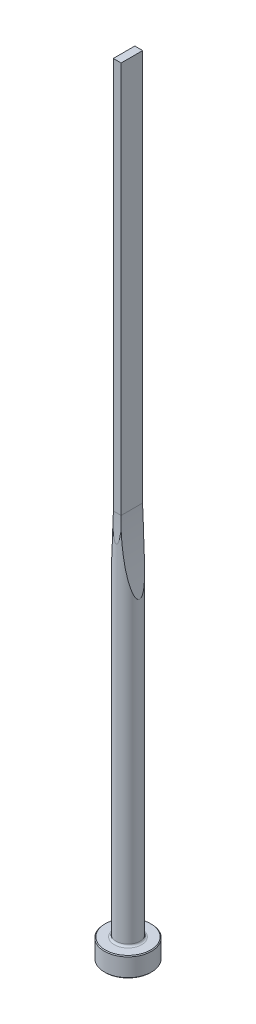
ISO-10303-21;
HEADER;
FILE_DESCRIPTION(('STEP AP214'),'2;1');
FILE_NAME('part.step','',(''),(''),'','','');
FILE_SCHEMA(('AUTOMOTIVE_DESIGN { 1 0 10303 214 1 1 1 1 }'));
ENDSEC;
DATA;
#1=APPLICATION_CONTEXT('core data for automotive mechanical design processes');
#2=APPLICATION_PROTOCOL_DEFINITION('international standard','automotive_design',2000,#1);
#3=PRODUCT_CONTEXT('',#1,'mechanical');
#4=PRODUCT('Part','Part','',(#3));
#5=PRODUCT_RELATED_PRODUCT_CATEGORY('part','',(#4));
#6=PRODUCT_DEFINITION_FORMATION('','',#4);
#7=PRODUCT_DEFINITION_CONTEXT('part definition',#1,'design');
#8=PRODUCT_DEFINITION('design','',#6,#7);
#9=PRODUCT_DEFINITION_SHAPE('','',#8);
#10=(LENGTH_UNIT() NAMED_UNIT(*) SI_UNIT(.MILLI.,.METRE.));
#11=(NAMED_UNIT(*) PLANE_ANGLE_UNIT() SI_UNIT($,.RADIAN.));
#12=(NAMED_UNIT(*) SI_UNIT($,.STERADIAN.) SOLID_ANGLE_UNIT());
#13=UNCERTAINTY_MEASURE_WITH_UNIT(LENGTH_MEASURE(1.E-05),#10,'distance_accuracy_value','');
#14=(GEOMETRIC_REPRESENTATION_CONTEXT(3) GLOBAL_UNCERTAINTY_ASSIGNED_CONTEXT((#13)) GLOBAL_UNIT_ASSIGNED_CONTEXT((#10,
#11,#12)) REPRESENTATION_CONTEXT('',''));
#15=CARTESIAN_POINT('',(0.,0.,0.));
#16=DIRECTION('',(0.,0.,1.));
#17=DIRECTION('',(1.,0.,0.));
#18=AXIS2_PLACEMENT_3D('',#15,#16,#17);
#19=CARTESIAN_POINT('',(0.,0.,0.));
#20=DIRECTION('',(0.,1.,0.));
#21=DIRECTION('',(-1.,0.,0.));
#22=AXIS2_PLACEMENT_3D('',#19,#20,#21);
#23=PLANE('',#22);
#24=CARTESIAN_POINT('',(0.,0.,0.));
#25=DIRECTION('',(0.,1.,0.));
#26=DIRECTION('',(-1.,0.,0.));
#27=AXIS2_PLACEMENT_3D('',#24,#25,#26);
#28=CIRCLE('',#27,5.8);
#29=CARTESIAN_POINT('',(-5.8,0.,0.));
#30=VERTEX_POINT('',#29);
#31=EDGE_CURVE('E133',#30,#30,#28,.T.);
#32=ORIENTED_EDGE('',*,*,#31,.F.);
#33=EDGE_LOOP('',(#32));
#34=FACE_BOUND('',#33,.T.);
#35=ADVANCED_FACE('F32',(#34),#23,.F.);
#36=CARTESIAN_POINT('',(0.,0.,0.));
#37=DIRECTION('',(0.,1.,0.));
#38=DIRECTION('',(-1.,0.,0.));
#39=AXIS2_PLACEMENT_3D('',#36,#37,#38);
#40=CONICAL_SURFACE('',#39,5.8,0.785398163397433);
#41=CARTESIAN_POINT('',(0.,0.200000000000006,0.));
#42=DIRECTION('',(0.,1.,0.));
#43=DIRECTION('',(-1.,0.,0.));
#44=AXIS2_PLACEMENT_3D('',#41,#42,#43);
#45=CIRCLE('',#44,6.);
#46=CARTESIAN_POINT('',(-6.,0.200000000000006,0.));
#47=VERTEX_POINT('',#46);
#48=EDGE_CURVE('E130',#47,#47,#45,.T.);
#49=ORIENTED_EDGE('',*,*,#48,.F.);
#50=EDGE_LOOP('',(#49));
#51=FACE_BOUND('',#50,.T.);
#52=ORIENTED_EDGE('',*,*,#31,.T.);
#53=EDGE_LOOP('',(#52));
#54=FACE_BOUND('',#53,.T.);
#55=ADVANCED_FACE('F171',(#51,#54),#40,.T.);
#56=CARTESIAN_POINT('',(0.,200.,0.));
#57=DIRECTION('',(0.,1.,0.));
#58=DIRECTION('',(-1.,0.,0.));
#59=AXIS2_PLACEMENT_3D('',#56,#57,#58);
#60=CYLINDRICAL_SURFACE('',#59,6.);
#61=CARTESIAN_POINT('',(0.,4.8,0.));
#62=DIRECTION('',(0.,1.,0.));
#63=DIRECTION('',(-1.,0.,0.));
#64=AXIS2_PLACEMENT_3D('',#61,#62,#63);
#65=CIRCLE('',#64,6.);
#66=CARTESIAN_POINT('',(-6.,4.8,0.));
#67=VERTEX_POINT('',#66);
#68=EDGE_CURVE('E127',#67,#67,#65,.T.);
#69=ORIENTED_EDGE('',*,*,#68,.F.);
#70=EDGE_LOOP('',(#69));
#71=FACE_BOUND('',#70,.T.);
#72=ORIENTED_EDGE('',*,*,#48,.T.);
#73=EDGE_LOOP('',(#72));
#74=FACE_BOUND('',#73,.T.);
#75=ADVANCED_FACE('F176',(#71,#74),#60,.T.);
#76=CARTESIAN_POINT('',(0.,4.8,0.));
#77=DIRECTION('',(0.,-1.,0.));
#78=DIRECTION('',(1.,0.,0.));
#79=AXIS2_PLACEMENT_3D('',#76,#77,#78);
#80=CONICAL_SURFACE('',#79,6.,0.785398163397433);
#81=CARTESIAN_POINT('',(0.,5.,0.));
#82=DIRECTION('',(0.,1.,0.));
#83=DIRECTION('',(-1.,0.,0.));
#84=AXIS2_PLACEMENT_3D('',#81,#82,#83);
#85=CIRCLE('',#84,5.8);
#86=CARTESIAN_POINT('',(-5.8,5.,0.));
#87=VERTEX_POINT('',#86);
#88=EDGE_CURVE('E124',#87,#87,#85,.T.);
#89=ORIENTED_EDGE('',*,*,#88,.F.);
#90=EDGE_LOOP('',(#89));
#91=FACE_BOUND('',#90,.T.);
#92=ORIENTED_EDGE('',*,*,#68,.T.);
#93=EDGE_LOOP('',(#92));
#94=FACE_BOUND('',#93,.T.);
#95=ADVANCED_FACE('F183',(#91,#94),#80,.T.);
#96=CARTESIAN_POINT('',(5.8,5.,0.));
#97=DIRECTION('',(0.,-1.,0.));
#98=DIRECTION('',(1.,0.,0.));
#99=AXIS2_PLACEMENT_3D('',#96,#97,#98);
#100=PLANE('',#99);
#101=CARTESIAN_POINT('',(0.,5.,0.));
#102=DIRECTION('',(0.,1.,0.));
#103=DIRECTION('',(-1.,0.,0.));
#104=AXIS2_PLACEMENT_3D('',#101,#102,#103);
#105=CIRCLE('',#104,3.50000000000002);
#106=CARTESIAN_POINT('',(-3.50000000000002,5.,0.));
#107=VERTEX_POINT('',#106);
#108=EDGE_CURVE('E121',#107,#107,#105,.T.);
#109=ORIENTED_EDGE('',*,*,#108,.F.);
#110=EDGE_LOOP('',(#109));
#111=FACE_BOUND('',#110,.T.);
#112=ORIENTED_EDGE('',*,*,#88,.T.);
#113=EDGE_LOOP('',(#112));
#114=FACE_BOUND('',#113,.T.);
#115=ADVANCED_FACE('F190',(#111,#114),#100,.F.);
#116=CARTESIAN_POINT('',(0.,5.5,0.));
#117=DIRECTION('',(0.,1.,0.));
#118=DIRECTION('',(-1.,0.,0.));
#119=AXIS2_PLACEMENT_3D('',#116,#117,#118);
#120=TOROIDAL_SURFACE('',#119,3.50000000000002,0.5);
#121=CARTESIAN_POINT('',(0.,5.50000000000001,0.));
#122=DIRECTION('',(0.,1.,0.));
#123=DIRECTION('',(-1.,0.,0.));
#124=AXIS2_PLACEMENT_3D('',#121,#122,#123);
#125=CIRCLE('',#124,3.00000000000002);
#126=CARTESIAN_POINT('',(-3.00000000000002,5.50000000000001,0.));
#127=VERTEX_POINT('',#126);
#128=EDGE_CURVE('E112',#127,#127,#125,.T.);
#129=ORIENTED_EDGE('',*,*,#128,.F.);
#130=EDGE_LOOP('',(#129));
#131=FACE_BOUND('',#130,.T.);
#132=ORIENTED_EDGE('',*,*,#108,.T.);
#133=EDGE_LOOP('',(#132));
#134=FACE_BOUND('',#133,.T.);
#135=ADVANCED_FACE('F168',(#131,#134),#120,.F.);
#136=CARTESIAN_POINT('',(0.,200.,0.));
#137=DIRECTION('',(0.,1.,0.));
#138=DIRECTION('',(-1.,0.,0.));
#139=AXIS2_PLACEMENT_3D('',#136,#137,#138);
#140=CYLINDRICAL_SURFACE('',#139,3.00000000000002);
#141=CARTESIAN_POINT('',(3.00000000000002,81.1320377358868,0.));
#142=CARTESIAN_POINT('',(3.00000022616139,81.1320366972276,0.038228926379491));
#143=CARTESIAN_POINT('',(2.99926110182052,81.1354829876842,0.0764552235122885));
#144=CARTESIAN_POINT('',(2.99639888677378,81.1488399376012,0.151714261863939));
#145=CARTESIAN_POINT('',(2.99427413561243,81.1587583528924,0.188745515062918));
#146=CARTESIAN_POINT('',(2.98807781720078,81.1877213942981,0.271228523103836));
#147=CARTESIAN_POINT('',(2.9836202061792,81.2085792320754,0.316004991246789));
#148=CARTESIAN_POINT('',(2.97331057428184,81.2569328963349,0.401613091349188));
#149=CARTESIAN_POINT('',(2.96745548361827,81.2844433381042,0.442435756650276));
#150=CARTESIAN_POINT('',(2.95008756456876,81.366275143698,0.549315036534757));
#151=CARTESIAN_POINT('',(2.93760642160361,81.42531563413,0.611548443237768));
#152=CARTESIAN_POINT('',(2.91115377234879,81.5511686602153,0.727109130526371));
#153=CARTESIAN_POINT('',(2.89717771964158,81.6180049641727,0.780407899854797));
#154=CARTESIAN_POINT('',(2.86113354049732,81.79144447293,0.905584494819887));
#155=CARTESIAN_POINT('',(2.83855915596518,81.9010113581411,0.973158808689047));
#156=CARTESIAN_POINT('',(2.7926901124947,82.1258908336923,1.09783888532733));
#157=CARTESIAN_POINT('',(2.76939390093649,82.2412161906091,1.15491994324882));
#158=CARTESIAN_POINT('',(2.72247570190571,82.4759281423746,1.26155854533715));
#159=CARTESIAN_POINT('',(2.69885265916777,82.5953324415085,1.31107625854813));
#160=CARTESIAN_POINT('',(2.65169557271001,82.8363122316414,1.40399899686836));
#161=CARTESIAN_POINT('',(2.62816145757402,82.957885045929,1.44741103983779));
#162=CARTESIAN_POINT('',(2.58116352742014,83.2034207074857,1.52965685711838));
#163=CARTESIAN_POINT('',(2.55770101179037,83.3273935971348,1.56846116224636));
#164=CARTESIAN_POINT('',(2.51108712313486,83.5765905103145,1.64205076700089));
#165=CARTESIAN_POINT('',(2.48793578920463,83.7018146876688,1.67683556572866));
#166=CARTESIAN_POINT('',(2.41902942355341,84.0790398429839,1.77618649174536));
#167=CARTESIAN_POINT('',(2.37384496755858,84.3324737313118,1.83571063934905));
#168=CARTESIAN_POINT('',(2.28521389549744,84.8423645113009,1.94492030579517));
#169=CARTESIAN_POINT('',(2.24177182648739,85.0988273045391,1.99458126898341));
#170=CARTESIAN_POINT('',(2.15691582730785,85.6133961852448,2.08604943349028));
#171=CARTESIAN_POINT('',(2.11550134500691,85.8715018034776,2.12785878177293));
#172=CARTESIAN_POINT('',(2.03467618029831,86.3897050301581,2.20527247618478));
#173=CARTESIAN_POINT('',(1.99527148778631,86.6498062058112,2.2408589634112));
#174=CARTESIAN_POINT('',(1.91865388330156,87.1710031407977,2.30679847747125));
#175=CARTESIAN_POINT('',(1.88144110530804,87.4320989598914,2.33715118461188));
#176=CARTESIAN_POINT('',(1.80931117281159,87.954648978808,2.39342463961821));
#177=CARTESIAN_POINT('',(1.77439043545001,88.2161019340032,2.41935241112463));
#178=CARTESIAN_POINT('',(1.70680986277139,88.7396329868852,2.46749161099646));
#179=CARTESIAN_POINT('',(1.67414999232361,89.0017110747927,2.4897030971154));
#180=CARTESIAN_POINT('',(1.57940518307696,89.790293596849,2.55171073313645));
#181=CARTESIAN_POINT('',(1.52076944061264,90.3175940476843,2.58671983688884));
#182=CARTESIAN_POINT('',(1.41278591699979,91.3737084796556,2.64723210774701));
#183=CARTESIAN_POINT('',(1.36343895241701,91.902522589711,2.67273443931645));
#184=CARTESIAN_POINT('',(1.27407912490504,92.9614251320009,2.71646757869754));
#185=CARTESIAN_POINT('',(1.23406961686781,93.4915139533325,2.7346957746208));
#186=CARTESIAN_POINT('',(1.16344309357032,94.5524599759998,2.7654799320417));
#187=CARTESIAN_POINT('',(1.13282580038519,95.0833171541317,2.77803606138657));
#188=CARTESIAN_POINT('',(1.08091639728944,96.1473323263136,2.79864265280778));
#189=CARTESIAN_POINT('',(1.05965545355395,96.68049212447,2.80667808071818));
#190=CARTESIAN_POINT('',(1.02661841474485,97.7471520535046,2.81892956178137));
#191=CARTESIAN_POINT('',(1.01484239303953,98.2806521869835,2.82314558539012));
#192=CARTESIAN_POINT('',(1.00078350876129,99.347622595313,2.82815977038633));
#193=CARTESIAN_POINT('',(0.998497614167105,99.8810928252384,2.82895902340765));
#194=CARTESIAN_POINT('',(1.00341174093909,100.947981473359,2.8272198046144));
#195=CARTESIAN_POINT('',(1.01061171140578,101.481399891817,2.82468135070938));
#196=CARTESIAN_POINT('',(1.03447469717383,102.547132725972,2.81602973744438));
#197=CARTESIAN_POINT('',(1.05112237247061,103.079447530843,2.80992237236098));
#198=CARTESIAN_POINT('',(1.09386114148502,104.143643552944,2.79356276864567));
#199=CARTESIAN_POINT('',(1.11995236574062,104.675524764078,2.78331047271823));
#200=CARTESIAN_POINT('',(1.18158570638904,105.739021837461,2.75771131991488));
#201=CARTESIAN_POINT('',(1.21713492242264,106.270637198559,2.74236063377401));
#202=CARTESIAN_POINT('',(1.29764729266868,107.332913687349,2.70519573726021));
#203=CARTESIAN_POINT('',(1.34261005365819,107.863574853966,2.68338179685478));
#204=CARTESIAN_POINT('',(1.44167101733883,108.921123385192,2.63148216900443));
#205=CARTESIAN_POINT('',(1.49572528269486,109.448016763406,2.60143584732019));
#206=CARTESIAN_POINT('',(1.61305086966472,110.500166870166,2.53037775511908));
#207=CARTESIAN_POINT('',(1.67632381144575,111.025423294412,2.48936405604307));
#208=CARTESIAN_POINT('',(1.77798081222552,111.811051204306,2.41671078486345));
#209=CARTESIAN_POINT('',(1.81296647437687,112.072384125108,2.39065784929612));
#210=CARTESIAN_POINT('',(1.88516434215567,112.59426229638,2.33415203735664));
#211=CARTESIAN_POINT('',(1.92237646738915,112.854807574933,2.30369931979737));
#212=CARTESIAN_POINT('',(1.99897145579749,113.374825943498,2.23755936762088));
#213=CARTESIAN_POINT('',(2.03835358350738,113.634299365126,2.20187389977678));
#214=CARTESIAN_POINT('',(2.11923244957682,114.151952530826,2.1241494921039));
#215=CARTESIAN_POINT('',(2.16072897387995,114.410132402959,2.08211119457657));
#216=CARTESIAN_POINT('',(2.2243895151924,114.795534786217,2.01322026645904));
#217=CARTESIAN_POINT('',(2.24579780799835,114.923416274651,1.9893423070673));
#218=CARTESIAN_POINT('',(2.2890951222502,115.178672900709,1.93936563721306));
#219=CARTESIAN_POINT('',(2.31098417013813,115.306048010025,1.91326680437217));
#220=CARTESIAN_POINT('',(2.35524194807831,115.560319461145,1.85851444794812));
#221=CARTESIAN_POINT('',(2.37761118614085,115.687215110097,1.82985810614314));
#222=CARTESIAN_POINT('',(2.42277149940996,115.940235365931,1.76963159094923));
#223=CARTESIAN_POINT('',(2.44556255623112,116.0663600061,1.73806154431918));
#224=CARTESIAN_POINT('',(2.49132183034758,116.316553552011,1.67180247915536));
#225=CARTESIAN_POINT('',(2.51428679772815,116.440630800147,1.63714288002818));
#226=CARTESIAN_POINT('',(2.5605201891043,116.687545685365,1.56384666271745));
#227=CARTESIAN_POINT('',(2.58378858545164,116.810383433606,1.52521040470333));
#228=CARTESIAN_POINT('',(2.63049823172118,117.054223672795,1.44315833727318));
#229=CARTESIAN_POINT('',(2.65393918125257,117.175228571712,1.39974955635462));
#230=CARTESIAN_POINT('',(2.70086752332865,117.414881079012,1.30691723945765));
#231=CARTESIAN_POINT('',(2.72435488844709,117.533529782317,1.25749657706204));
#232=CARTESIAN_POINT('',(2.75720311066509,117.697772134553,1.18253203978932));
#233=CARTESIAN_POINT('',(2.76665795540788,117.744847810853,1.1602679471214));
#234=CARTESIAN_POINT('',(2.78550256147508,117.838293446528,1.11426796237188));
#235=CARTESIAN_POINT('',(2.79489231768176,117.884663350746,1.09053195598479));
#236=CARTESIAN_POINT('',(2.82298244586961,118.022830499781,1.01664624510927));
#237=CARTESIAN_POINT('',(2.84153288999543,118.113331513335,0.963976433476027));
#238=CARTESIAN_POINT('',(2.87800082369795,118.289926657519,0.849014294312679));
#239=CARTESIAN_POINT('',(2.8959086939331,118.375958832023,0.786619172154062));
#240=CARTESIAN_POINT('',(2.92128092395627,118.49705285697,0.683622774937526));
#241=CARTESIAN_POINT('',(2.92947327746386,118.536012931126,0.647814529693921));
#242=CARTESIAN_POINT('',(2.94512917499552,118.610243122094,0.572450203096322));
#243=CARTESIAN_POINT('',(2.95259387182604,118.645519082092,0.53290025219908));
#244=CARTESIAN_POINT('',(2.96507601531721,118.704354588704,0.457682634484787));
#245=CARTESIAN_POINT('',(2.9702856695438,118.728852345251,0.422789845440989));
#246=CARTESIAN_POINT('',(2.97973939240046,118.77323192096,0.3499984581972));
#247=CARTESIAN_POINT('',(2.98398345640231,118.793113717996,0.312099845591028));
#248=CARTESIAN_POINT('',(2.99120737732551,118.826914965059,0.232964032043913));
#249=CARTESIAN_POINT('',(2.99417050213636,118.84075552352,0.191690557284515));
#250=CARTESIAN_POINT('',(2.99838013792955,118.860408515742,0.107202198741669));
#251=CARTESIAN_POINT('',(2.99963012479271,118.866237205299,0.063991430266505));
#252=CARTESIAN_POINT('',(3.00019630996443,118.868877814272,-0.0181336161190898));
#253=CARTESIAN_POINT('',(2.99970295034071,118.866577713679,-0.0570192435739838));
#254=CARTESIAN_POINT('',(2.99726373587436,118.855196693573,-0.133743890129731));
#255=CARTESIAN_POINT('',(2.99531641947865,118.846108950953,-0.171581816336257));
#256=CARTESIAN_POINT('',(2.9895941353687,118.819369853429,-0.253764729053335));
#257=CARTESIAN_POINT('',(2.9855008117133,118.800224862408,-0.297592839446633));
#258=CARTESIAN_POINT('',(2.97593628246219,118.755392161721,-0.381574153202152));
#259=CARTESIAN_POINT('',(2.97046224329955,118.729690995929,-0.421719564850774));
#260=CARTESIAN_POINT('',(2.95432862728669,118.653742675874,-0.525716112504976));
#261=CARTESIAN_POINT('',(2.94274979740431,118.599037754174,-0.586122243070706));
#262=CARTESIAN_POINT('',(2.91810481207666,118.481974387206,-0.698550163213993));
#263=CARTESIAN_POINT('',(2.90503417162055,118.419592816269,-0.750545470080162));
#264=CARTESIAN_POINT('',(2.87174720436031,118.259803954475,-0.870990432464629));
#265=CARTESIAN_POINT('',(2.85105828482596,118.159708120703,-0.93569685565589));
#266=CARTESIAN_POINT('',(2.80892115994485,117.953961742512,-1.0554416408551));
#267=CARTESIAN_POINT('',(2.78747133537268,117.848299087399,-1.11045768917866));
#268=CARTESIAN_POINT('',(2.74418685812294,117.633024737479,-1.21349533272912));
#269=CARTESIAN_POINT('',(2.72235077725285,117.523395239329,-1.26147873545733));
#270=CARTESIAN_POINT('',(2.67868820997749,117.301982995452,-1.35171430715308));
#271=CARTESIAN_POINT('',(2.6568617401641,117.190202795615,-1.39397282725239));
#272=CARTESIAN_POINT('',(2.61377608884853,116.967264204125,-1.47314729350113));
#273=CARTESIAN_POINT('',(2.59251428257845,116.856137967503,-1.51015307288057));
#274=CARTESIAN_POINT('',(2.55020507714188,116.632700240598,-1.58054872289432));
#275=CARTESIAN_POINT('',(2.52915770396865,116.520388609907,-1.61393815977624));
#276=CARTESIAN_POINT('',(2.46641237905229,116.181980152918,-1.70957968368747));
#277=CARTESIAN_POINT('',(2.42513167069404,115.954515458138,-1.76726883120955));
#278=CARTESIAN_POINT('',(2.34389066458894,115.496725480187,-1.87366866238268));
#279=CARTESIAN_POINT('',(2.3039337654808,115.26639465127,-1.92235751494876));
#280=CARTESIAN_POINT('',(2.22560869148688,114.804134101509,-2.01251797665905));
#281=CARTESIAN_POINT('',(2.18724009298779,114.572204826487,-2.05399151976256));
#282=CARTESIAN_POINT('',(2.11209208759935,114.106579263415,-2.13118981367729));
#283=CARTESIAN_POINT('',(2.07531657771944,113.872880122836,-2.16690099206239));
#284=CARTESIAN_POINT('',(2.00351057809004,113.404514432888,-2.23345911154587));
#285=CARTESIAN_POINT('',(1.96848019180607,113.16984782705,-2.26430576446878));
#286=CARTESIAN_POINT('',(1.90025903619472,112.700094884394,-2.32185349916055));
#287=CARTESIAN_POINT('',(1.86706568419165,112.465009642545,-2.34856050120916));
#288=CARTESIAN_POINT('',(1.80249449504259,111.994226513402,-2.39847310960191));
#289=CARTESIAN_POINT('',(1.77111663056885,111.758528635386,-2.42167876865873));
#290=CARTESIAN_POINT('',(1.67974647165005,111.050729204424,-2.48678077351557));
#291=CARTESIAN_POINT('',(1.62250766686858,110.577853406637,-2.52417022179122));
#292=CARTESIAN_POINT('',(1.51548416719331,109.630611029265,-2.58983087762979));
#293=CARTESIAN_POINT('',(1.46570013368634,109.156244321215,-2.61810127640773));
#294=CARTESIAN_POINT('',(1.37363740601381,108.206273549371,-2.66755500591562));
#295=CARTESIAN_POINT('',(1.33136100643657,107.730669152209,-2.68873617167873));
#296=CARTESIAN_POINT('',(1.25436923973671,106.778631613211,-2.7255042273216));
#297=CARTESIAN_POINT('',(1.21965398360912,106.302198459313,-2.74109103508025));
#298=CARTESIAN_POINT('',(1.1577468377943,105.347774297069,-2.7678077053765));
#299=CARTESIAN_POINT('',(1.13056996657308,104.869782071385,-2.77892869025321));
#300=CARTESIAN_POINT('',(1.08384507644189,103.91335186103,-2.79748288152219));
#301=CARTESIAN_POINT('',(1.06429711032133,103.434913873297,-2.80491606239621));
#302=CARTESIAN_POINT('',(1.03284197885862,102.477838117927,-2.8166502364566));
#303=CARTESIAN_POINT('',(1.02093339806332,101.999200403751,-2.82095180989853));
#304=CARTESIAN_POINT('',(1.00475611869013,101.041780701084,-2.82675409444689));
#305=CARTESIAN_POINT('',(1.00048739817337,100.562998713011,-2.82825481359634));
#306=CARTESIAN_POINT('',(0.999592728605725,99.6068472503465,-2.82857110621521));
#307=CARTESIAN_POINT('',(1.00294414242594,99.1294777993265,-2.8273946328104));
#308=CARTESIAN_POINT('',(1.01724188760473,98.1748658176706,-2.82228220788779));
#309=CARTESIAN_POINT('',(1.02818823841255,97.6976232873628,-2.81834624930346));
#310=CARTESIAN_POINT('',(1.05767415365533,96.7433220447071,-2.80741397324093));
#311=CARTESIAN_POINT('',(1.07621506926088,96.2662633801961,-2.80041711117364));
#312=CARTESIAN_POINT('',(1.12088191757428,95.3125687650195,-2.78284043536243));
#313=CARTESIAN_POINT('',(1.1470078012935,94.8359328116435,-2.77226064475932));
#314=CARTESIAN_POINT('',(1.20678398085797,93.8840018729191,-2.74676682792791));
#315=CARTESIAN_POINT('',(1.24042234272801,93.408705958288,-2.73185966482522));
#316=CARTESIAN_POINT('',(1.31522508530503,92.4589081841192,-2.69664530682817));
#317=CARTESIAN_POINT('',(1.35638936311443,91.9844063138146,-2.67633818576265));
#318=CARTESIAN_POINT('',(1.44619587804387,91.0365906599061,-2.62889658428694));
#319=CARTESIAN_POINT('',(1.49483588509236,90.5632765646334,-2.60176413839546));
#320=CARTESIAN_POINT('',(1.59954373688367,89.6180706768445,-2.53874310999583));
#321=CARTESIAN_POINT('',(1.65561095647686,89.1461787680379,-2.50285526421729));
#322=CARTESIAN_POINT('',(1.74253420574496,88.4608699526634,-2.44226518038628));
#323=CARTESIAN_POINT('',(1.77048698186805,88.24667649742,-2.42211858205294));
#324=CARTESIAN_POINT('',(1.82789751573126,87.8187546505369,-2.37909262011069));
#325=CARTESIAN_POINT('',(1.85735533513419,87.6050262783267,-2.3562131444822));
#326=CARTESIAN_POINT('',(1.9177413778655,87.1782362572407,-2.30733108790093));
#327=CARTESIAN_POINT('',(1.94866890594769,86.9651743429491,-2.28132997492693));
#328=CARTESIAN_POINT('',(2.01197930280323,86.5397466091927,-2.22569407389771));
#329=CARTESIAN_POINT('',(2.0443621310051,86.3273807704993,-2.19605938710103));
#330=CARTESIAN_POINT('',(2.12282503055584,85.8248724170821,-2.12075062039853));
#331=CARTESIAN_POINT('',(2.16952977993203,85.5351034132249,-2.07320475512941));
#332=CARTESIAN_POINT('',(2.26547737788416,84.957722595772,-1.96792275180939));
#333=CARTESIAN_POINT('',(2.31472085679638,84.6701113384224,-1.9101840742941));
#334=CARTESIAN_POINT('',(2.39992455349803,84.1864939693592,-1.80098498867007));
#335=CARTESIAN_POINT('',(2.43529880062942,83.9895864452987,-1.75307812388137));
#336=CARTESIAN_POINT('',(2.50693863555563,83.5982442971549,-1.64902256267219));
#337=CARTESIAN_POINT('',(2.54320352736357,83.4038079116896,-1.59288014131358));
#338=CARTESIAN_POINT('',(2.60534464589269,83.0765342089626,-1.48817918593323));
#339=CARTESIAN_POINT('',(2.63106114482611,82.942776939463,-1.44242693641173));
#340=CARTESIAN_POINT('',(2.68266526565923,82.6775673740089,-1.34402450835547));
#341=CARTESIAN_POINT('',(2.70855310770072,82.5461195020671,-1.29136244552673));
#342=CARTESIAN_POINT('',(2.76181569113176,82.2787562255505,-1.17340697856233));
#343=CARTESIAN_POINT('',(2.78918019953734,82.1430889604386,-1.10752295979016));
#344=CARTESIAN_POINT('',(2.82944954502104,81.9456774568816,-0.997847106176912));
#345=CARTESIAN_POINT('',(2.84272536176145,81.8809733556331,-0.959540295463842));
#346=CARTESIAN_POINT('',(2.86883651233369,81.7543929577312,-0.878409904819));
#347=CARTESIAN_POINT('',(2.88167220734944,81.6925143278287,-0.835590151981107));
#348=CARTESIAN_POINT('',(2.90412303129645,81.5848198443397,-0.753328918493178));
#349=CARTESIAN_POINT('',(2.91387080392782,81.5382576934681,-0.714910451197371));
#350=CARTESIAN_POINT('',(2.93264854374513,81.4488897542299,-0.633500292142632));
#351=CARTESIAN_POINT('',(2.94167693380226,81.406092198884,-0.59049901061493));
#352=CARTESIAN_POINT('',(2.9586847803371,81.3257257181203,-0.498414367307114));
#353=CARTESIAN_POINT('',(2.96664701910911,81.2882421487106,-0.449251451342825));
#354=CARTESIAN_POINT('',(2.98058913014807,81.2227682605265,-0.344714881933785));
#355=CARTESIAN_POINT('',(2.98657844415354,81.194732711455,-0.289372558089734));
#356=CARTESIAN_POINT('',(2.99392843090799,81.1603726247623,-0.194344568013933));
#357=CARTESIAN_POINT('',(2.99617998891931,81.149861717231,-0.156258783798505));
#358=CARTESIAN_POINT('',(2.99921465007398,81.1356995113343,-0.0787798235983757));
#359=CARTESIAN_POINT('',(2.99999976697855,81.1320388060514,-0.0393885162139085));
#360=CARTESIAN_POINT('',(3.00000000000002,81.1320377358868,0.));
#361=B_SPLINE_CURVE_WITH_KNOTS('',3,(#141,#142,#143,#144,#145,#146,#147,#148,#149,#150,#151,
#152,#153,#154,#155,#156,#157,#158,#159,#160,#161,#162,#163,#164,#165,#166,#167,#168,#169,#170,
#171,#172,#173,#174,#175,#176,#177,#178,#179,#180,#181,#182,#183,#184,#185,#186,#187,#188,#189,
#190,#191,#192,#193,#194,#195,#196,#197,#198,#199,#200,#201,#202,#203,#204,#205,#206,#207,#208,
#209,#210,#211,#212,#213,#214,#215,#216,#217,#218,#219,#220,#221,#222,#223,#224,#225,#226,#227,
#228,#229,#230,#231,#232,#233,#234,#235,#236,#237,#238,#239,#240,#241,#242,#243,#244,#245,#246,
#247,#248,#249,#250,#251,#252,#253,#254,#255,#256,#257,#258,#259,#260,#261,#262,#263,#264,#265,
#266,#267,#268,#269,#270,#271,#272,#273,#274,#275,#276,#277,#278,#279,#280,#281,#282,#283,#284,
#285,#286,#287,#288,#289,#290,#291,#292,#293,#294,#295,#296,#297,#298,#299,#300,#301,#302,#303,
#304,#305,#306,#307,#308,#309,#310,#311,#312,#313,#314,#315,#316,#317,#318,#319,#320,#321,#322,
#323,#324,#325,#326,#327,#328,#329,#330,#331,#332,#333,#334,#335,#336,#337,#338,#339,#340,#341,
#342,#343,#344,#345,#346,#347,#348,#349,#350,#351,#352,#353,#354,#355,#356,#357,#358,#359,#360),
.UNSPECIFIED.,.T.,.F.,(4,2,2,2,2,2,2,2,2,2,2,2,2,2,2,2,2,2,2,2,2,2,2,2,2,2,2,2,2,2,2,2,2,2,2,2,
2,2,2,2,2,2,2,2,2,2,2,2,2,2,2,2,2,2,2,2,2,2,2,2,2,2,2,2,2,2,2,2,2,2,2,2,2,2,2,2,2,2,2,2,2,2,2,2,
2,2,2,2,2,2,2,2,2,2,2,2,2,2,2,2,2,2,2,2,2,2,2,2,2,4),(0.,0.11453074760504,0.229198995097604,
0.377146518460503,0.525422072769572,0.784016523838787,1.04342108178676,1.4345096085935,
1.82650742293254,2.22050328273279,2.61404251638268,3.00997666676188,3.40596010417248,
4.1983099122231,4.99260830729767,5.78668919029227,6.58301287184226,7.37938517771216,
8.1744814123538,8.96956528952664,10.5644564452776,12.1594877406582,13.7550912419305,
15.35064752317,16.9514791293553,18.5523231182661,20.1526556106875,21.7529795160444,
23.3507124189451,24.9484674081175,26.5474251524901,28.1463161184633,29.737691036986,
31.3293459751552,32.1241543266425,32.9189339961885,33.7134459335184,34.5078775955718,
34.9033853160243,35.2989148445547,35.6948857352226,36.09083940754,36.4833596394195,
36.8758443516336,37.2677586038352,37.6594862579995,37.8182445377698,37.9770151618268,
38.2957346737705,38.6180854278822,38.778539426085,38.938734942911,39.0673064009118,
39.1958784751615,39.326082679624,39.4560223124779,39.5722268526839,39.6885483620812,
39.8317500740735,39.9752480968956,40.2207965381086,40.4671036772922,40.8291068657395,
41.1919330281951,41.5566618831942,41.920982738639,42.2780286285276,42.6351172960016,
43.3496348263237,44.0658633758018,44.7818996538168,45.4995985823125,46.2173400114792,
46.9340453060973,47.6507398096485,49.0839199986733,50.5172272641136,51.9509718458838,
53.3847374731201,54.8213393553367,56.2579511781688,57.6942967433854,59.1306381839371,
60.562718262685,61.9948020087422,63.4271406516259,64.8594700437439,66.2895400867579,
67.7195905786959,69.1492152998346,70.5787197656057,71.2295431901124,71.8803933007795,
72.5309385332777,73.1814656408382,74.073325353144,74.9654075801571,75.5824262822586,
76.198977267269,76.6298882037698,77.0615502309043,77.5206861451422,77.7496251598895,
77.9783715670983,78.1616043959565,78.3452284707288,78.5315304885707,78.7169275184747,
78.8350946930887,78.9530994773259),.UNSPECIFIED.);
#362=CARTESIAN_POINT('',(1.05745310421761,96.7846838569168,-2.80745310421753));
#363=VERTEX_POINT('',#362);
#364=CARTESIAN_POINT('',(1.05745310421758,96.7846838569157,2.80745310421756));
#365=VERTEX_POINT('',#364);
#366=EDGE_CURVE('E138',#363,#365,#361,.T.);
#367=ORIENTED_EDGE('',*,*,#366,.T.);
#368=CARTESIAN_POINT('',(-1.19895788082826,100.,2.74999999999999));
#369=CARTESIAN_POINT('',(-1.19897952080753,100.507824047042,2.7500005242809));
#370=CARTESIAN_POINT('',(-1.18927252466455,101.015682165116,2.7543014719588));
#371=CARTESIAN_POINT('',(-1.15875125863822,101.7777588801,2.76719867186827));
#372=CARTESIAN_POINT('',(-1.1458730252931,102.032372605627,2.77259034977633));
#373=CARTESIAN_POINT('',(-1.11408427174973,102.541075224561,2.7855202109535));
#374=CARTESIAN_POINT('',(-1.09517627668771,102.795164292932,2.79305749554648));
#375=CARTESIAN_POINT('',(-1.05054489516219,103.299287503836,2.81014523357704));
#376=CARTESIAN_POINT('',(-1.02491501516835,103.549330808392,2.81966772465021));
#377=CARTESIAN_POINT('',(-0.96493247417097,104.048715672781,2.84076574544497));
#378=CARTESIAN_POINT('',(-0.930566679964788,104.298055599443,2.85234435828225));
#379=CARTESIAN_POINT('',(-0.870049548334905,104.669653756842,2.87113933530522));
#380=CARTESIAN_POINT('',(-0.848472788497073,104.792694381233,2.87761721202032));
#381=CARTESIAN_POINT('',(-0.801568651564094,105.038027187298,2.89103629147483));
#382=CARTESIAN_POINT('',(-0.776241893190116,105.16031948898,2.89797741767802));
#383=CARTESIAN_POINT('',(-0.720753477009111,105.403474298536,2.91227256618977));
#384=CARTESIAN_POINT('',(-0.690603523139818,105.52433952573,2.91962556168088));
#385=CARTESIAN_POINT('',(-0.623527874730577,105.764129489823,2.93469409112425));
#386=CARTESIAN_POINT('',(-0.586609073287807,105.883056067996,2.94240925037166));
#387=CARTESIAN_POINT('',(-0.532225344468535,106.033125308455,2.95243594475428));
#388=CARTESIAN_POINT('',(-0.519782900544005,106.066091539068,2.9546570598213));
#389=CARTESIAN_POINT('',(-0.493824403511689,106.131601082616,2.95910656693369));
#390=CARTESIAN_POINT('',(-0.480308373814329,106.164144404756,2.96133495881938));
#391=CARTESIAN_POINT('',(-0.437923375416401,106.26078152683,2.96800415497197));
#392=CARTESIAN_POINT('',(-0.407160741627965,106.324045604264,2.97243989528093));
#393=CARTESIAN_POINT('',(-0.33948043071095,106.443295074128,2.98092262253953));
#394=CARTESIAN_POINT('',(-0.302974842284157,106.499488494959,2.98497775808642));
#395=CARTESIAN_POINT('',(-0.24324965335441,106.570609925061,2.99016761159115));
#396=CARTESIAN_POINT('',(-0.225380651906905,106.589912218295,2.99158318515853));
#397=CARTESIAN_POINT('',(-0.187063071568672,106.625785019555,2.99422420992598));
#398=CARTESIAN_POINT('',(-0.166623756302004,106.642364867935,2.9954503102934));
#399=CARTESIAN_POINT('',(-0.132225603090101,106.66474699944,2.9971102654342));
#400=CARTESIAN_POINT('',(-0.119296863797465,106.672106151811,2.99765718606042));
#401=CARTESIAN_POINT('',(-0.0924786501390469,106.684833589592,2.99860424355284));
#402=CARTESIAN_POINT('',(-0.0785901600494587,106.690203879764,2.99900452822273));
#403=CARTESIAN_POINT('',(-0.0498799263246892,106.698454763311,2.99961993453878));
#404=CARTESIAN_POINT('',(-0.0350488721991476,106.701304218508,2.99983274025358));
#405=CARTESIAN_POINT('',(-0.00511706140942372,106.703983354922,3.00003281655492));
#406=CARTESIAN_POINT('',(0.00998340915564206,106.703816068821,3.00002031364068));
#407=CARTESIAN_POINT('',(0.0377473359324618,106.70073399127,2.99979016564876));
#408=CARTESIAN_POINT('',(0.0504568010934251,106.698205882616,2.99960139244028));
#409=CARTESIAN_POINT('',(0.0753269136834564,106.691216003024,2.9990800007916));
#410=CARTESIAN_POINT('',(0.0874870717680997,106.686752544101,2.99874725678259));
#411=CARTESIAN_POINT('',(0.11730456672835,106.673490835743,2.99776000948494));
#412=CARTESIAN_POINT('',(0.134490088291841,106.66364736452,2.99702831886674));
#413=CARTESIAN_POINT('',(0.167153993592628,106.641469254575,2.99538445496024));
#414=CARTESIAN_POINT('',(0.182627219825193,106.629127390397,2.9944717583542));
#415=CARTESIAN_POINT('',(0.225718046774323,106.590611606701,2.99163284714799));
#416=CARTESIAN_POINT('',(0.25130789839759,106.56221507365,2.98955095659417));
#417=CARTESIAN_POINT('',(0.298583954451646,106.502395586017,2.98519748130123));
#418=CARTESIAN_POINT('',(0.320256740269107,106.470962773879,2.98292528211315));
#419=CARTESIAN_POINT('',(0.376076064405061,106.38210264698,2.9765520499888));
#420=CARTESIAN_POINT('',(0.407351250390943,106.322898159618,2.97236032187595));
#421=CARTESIAN_POINT('',(0.464715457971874,106.201991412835,2.96392635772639));
#422=CARTESIAN_POINT('',(0.490790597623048,106.140282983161,2.95968401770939));
#423=CARTESIAN_POINT('',(0.539393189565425,106.01515332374,2.95121450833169));
#424=CARTESIAN_POINT('',(0.561903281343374,105.951725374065,2.94698750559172));
#425=CARTESIAN_POINT('',(0.604138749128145,105.824059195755,2.93861747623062));
#426=CARTESIAN_POINT('',(0.62386791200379,105.759822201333,2.93447434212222));
#427=CARTESIAN_POINT('',(0.687009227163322,105.541602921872,2.92063784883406));
#428=CARTESIAN_POINT('',(0.725502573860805,105.386187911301,2.91118093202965));
#429=CARTESIAN_POINT('',(0.794909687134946,105.073609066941,2.89298537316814));
#430=CARTESIAN_POINT('',(0.825818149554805,104.916444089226,2.88424723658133));
#431=CARTESIAN_POINT('',(0.882130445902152,104.600671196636,2.8675274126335));
#432=CARTESIAN_POINT('',(0.907519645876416,104.442060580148,2.85954776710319));
#433=CARTESIAN_POINT('',(0.953912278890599,104.124222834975,2.84440447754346));
#434=CARTESIAN_POINT('',(0.974917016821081,103.964995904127,2.83724059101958));
#435=CARTESIAN_POINT('',(1.03276252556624,103.485151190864,2.8169332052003));
#436=CARTESIAN_POINT('',(1.06419241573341,103.163825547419,2.8050512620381));
#437=CARTESIAN_POINT('',(1.11623470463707,102.520879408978,2.78473743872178));
#438=CARTESIAN_POINT('',(1.13686835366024,102.199260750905,2.77629878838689));
#439=CARTESIAN_POINT('',(1.16917424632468,101.55466711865,2.76284984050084));
#440=CARTESIAN_POINT('',(1.18082300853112,101.23169079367,2.75784852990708));
#441=CARTESIAN_POINT('',(1.19594203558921,100.585510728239,2.75132454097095));
#442=CARTESIAN_POINT('',(1.1994121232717,100.262306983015,2.74980193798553));
#443=CARTESIAN_POINT('',(1.19840705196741,99.614562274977,2.75024017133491));
#444=CARTESIAN_POINT('',(1.1938986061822,99.2900213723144,2.75221560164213));
#445=CARTESIAN_POINT('',(1.17656472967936,98.6413194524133,2.75967187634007));
#446=CARTESIAN_POINT('',(1.16374248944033,98.3171583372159,2.76515137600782));
#447=CARTESIAN_POINT('',(1.1290319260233,97.6736789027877,2.77950240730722));
#448=CARTESIAN_POINT('',(1.10726533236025,97.3543530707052,2.78832827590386));
#449=CARTESIAN_POINT('',(1.05280621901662,96.716271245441,2.80935794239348));
#450=CARTESIAN_POINT('',(1.02009944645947,96.3975165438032,2.82156614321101));
#451=CARTESIAN_POINT('',(0.960080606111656,95.9219501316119,2.84230016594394));
#452=CARTESIAN_POINT('',(0.938338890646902,95.7643795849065,2.84958669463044));
#453=CARTESIAN_POINT('',(0.89032516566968,95.449892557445,2.86495508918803));
#454=CARTESIAN_POINT('',(0.864051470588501,95.292976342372,2.87303725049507));
#455=CARTESIAN_POINT('',(0.805707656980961,94.9806378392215,2.88993979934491));
#456=CARTESIAN_POINT('',(0.77365112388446,94.8252129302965,2.89875843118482));
#457=CARTESIAN_POINT('',(0.701473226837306,94.5163138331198,2.91708269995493));
#458=CARTESIAN_POINT('',(0.661358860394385,94.3628380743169,2.92658773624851));
#459=CARTESIAN_POINT('',(0.599571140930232,94.1622791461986,2.93951368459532));
#460=CARTESIAN_POINT('',(0.583753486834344,94.113382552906,2.94270568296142));
#461=CARTESIAN_POINT('',(0.550376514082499,94.0161514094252,2.94913181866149));
#462=CARTESIAN_POINT('',(0.532816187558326,93.9678172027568,2.95236597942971));
#463=CARTESIAN_POINT('',(0.49547428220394,93.8718768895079,2.95886221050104));
#464=CARTESIAN_POINT('',(0.47568748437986,93.8242728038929,2.96212432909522));
#465=CARTESIAN_POINT('',(0.433230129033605,93.7303798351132,2.96863184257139));
#466=CARTESIAN_POINT('',(0.410562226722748,93.6840897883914,2.97187725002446));
#467=CARTESIAN_POINT('',(0.360948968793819,93.5932525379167,2.97831355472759));
#468=CARTESIAN_POINT('',(0.333963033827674,93.5487274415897,2.98150358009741));
#469=CARTESIAN_POINT('',(0.273823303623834,93.4640019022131,2.98763333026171));
#470=CARTESIAN_POINT('',(0.240714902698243,93.423772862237,2.99057467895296));
#471=CARTESIAN_POINT('',(0.187908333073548,93.3753088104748,2.9941441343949));
#472=CARTESIAN_POINT('',(0.172443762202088,93.3625865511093,2.99508437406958));
#473=CARTESIAN_POINT('',(0.139769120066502,93.3396025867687,2.99678704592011));
#474=CARTESIAN_POINT('',(0.122564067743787,93.3293340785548,2.99754996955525));
#475=CARTESIAN_POINT('',(0.0920979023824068,93.3150686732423,2.99861155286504));
#476=CARTESIAN_POINT('',(0.0792928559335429,93.3101148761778,2.99898077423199));
#477=CARTESIAN_POINT('',(0.0530412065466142,93.3023526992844,2.99955968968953));
#478=CARTESIAN_POINT('',(0.0395953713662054,93.299541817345,2.99976956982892));
#479=CARTESIAN_POINT('',(0.0123234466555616,93.2963783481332,3.00000579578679));
#480=CARTESIAN_POINT('',(-0.00150445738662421,93.2960408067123,3.00003101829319));
#481=CARTESIAN_POINT('',(-0.0289863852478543,93.2979088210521,2.99989150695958));
#482=CARTESIAN_POINT('',(-0.0426403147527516,93.3001157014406,2.99972667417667));
#483=CARTESIAN_POINT('',(-0.07131325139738,93.3072893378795,2.99919143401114));
#484=CARTESIAN_POINT('',(-0.0862409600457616,93.3126116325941,2.9987945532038));
#485=CARTESIAN_POINT('',(-0.115034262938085,93.3255893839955,2.99782852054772));
#486=CARTESIAN_POINT('',(-0.128897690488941,93.3332494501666,2.99725902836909));
#487=CARTESIAN_POINT('',(-0.16396857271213,93.3556775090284,2.99559526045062));
#488=CARTESIAN_POINT('',(-0.184247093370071,93.3718697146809,2.99439742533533));
#489=CARTESIAN_POINT('',(-0.222285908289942,93.4069419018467,2.9918143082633));
#490=CARTESIAN_POINT('',(-0.240038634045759,93.425829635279,2.99042848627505));
#491=CARTESIAN_POINT('',(-0.280818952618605,93.4738008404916,2.98692562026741));
#492=CARTESIAN_POINT('',(-0.302801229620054,93.5037572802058,2.98475182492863));
#493=CARTESIAN_POINT('',(-0.343876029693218,93.5656071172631,2.98029708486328));
#494=CARTESIAN_POINT('',(-0.362961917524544,93.5975047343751,2.97801590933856));
#495=CARTESIAN_POINT('',(-0.417189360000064,93.6952833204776,2.97107815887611));
#496=CARTESIAN_POINT('',(-0.449076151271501,93.7629467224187,2.96634960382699));
#497=CARTESIAN_POINT('',(-0.50752213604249,93.9004515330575,2.9569028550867));
#498=CARTESIAN_POINT('',(-0.534078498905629,93.970294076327,2.95218466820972));
#499=CARTESIAN_POINT('',(-0.583437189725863,94.1113147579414,2.9428266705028));
#500=CARTESIAN_POINT('',(-0.60623831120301,94.1824933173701,2.93818688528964));
#501=CARTESIAN_POINT('',(-0.670588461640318,94.3976071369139,2.92442540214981));
#502=CARTESIAN_POINT('',(-0.707956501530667,94.5427891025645,2.91548441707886));
#503=CARTESIAN_POINT('',(-0.775545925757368,94.8347309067,2.8982252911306));
#504=CARTESIAN_POINT('',(-0.805769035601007,94.9814903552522,2.88990700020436));
#505=CARTESIAN_POINT('',(-0.860937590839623,95.2758101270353,2.87395360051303));
#506=CARTESIAN_POINT('',(-0.885890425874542,95.4233690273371,2.86631754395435));
#507=CARTESIAN_POINT('',(-0.937056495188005,95.7534864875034,2.85005332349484));
#508=CARTESIAN_POINT('',(-0.962216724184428,95.9362151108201,2.84160657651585));
#509=CARTESIAN_POINT('',(-1.00766798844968,96.3023321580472,2.82580502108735));
#510=CARTESIAN_POINT('',(-1.02795847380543,96.4857206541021,2.81845033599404));
#511=CARTESIAN_POINT('',(-1.08284239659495,97.0369289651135,2.79803797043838));
#512=CARTESIAN_POINT('',(-1.11139411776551,97.4054154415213,2.78665055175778));
#513=CARTESIAN_POINT('',(-1.15618392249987,98.144970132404,2.76835525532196));
#514=CARTESIAN_POINT('',(-1.17236247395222,98.5160422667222,2.76146905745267));
#515=CARTESIAN_POINT('',(-1.19373453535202,99.2580705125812,2.75229417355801));
#516=CARTESIAN_POINT('',(-1.1989420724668,99.6290261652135,2.74999961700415));
#517=CARTESIAN_POINT('',(-1.19895788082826,100.,2.74999999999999));
#518=B_SPLINE_CURVE_WITH_KNOTS('',3,(#368,#369,#370,#371,#372,#373,#374,#375,#376,#377,#378,
#379,#380,#381,#382,#383,#384,#385,#386,#387,#388,#389,#390,#391,#392,#393,#394,#395,#396,#397,
#398,#399,#400,#401,#402,#403,#404,#405,#406,#407,#408,#409,#410,#411,#412,#413,#414,#415,#416,
#417,#418,#419,#420,#421,#422,#423,#424,#425,#426,#427,#428,#429,#430,#431,#432,#433,#434,#435,
#436,#437,#438,#439,#440,#441,#442,#443,#444,#445,#446,#447,#448,#449,#450,#451,#452,#453,#454,
#455,#456,#457,#458,#459,#460,#461,#462,#463,#464,#465,#466,#467,#468,#469,#470,#471,#472,#473,
#474,#475,#476,#477,#478,#479,#480,#481,#482,#483,#484,#485,#486,#487,#488,#489,#490,#491,#492,
#493,#494,#495,#496,#497,#498,#499,#500,#501,#502,#503,#504,#505,#506,#507,#508,#509,#510,#511,
#512,#513,#514,#515,#516,#517),.UNSPECIFIED.,.T.,.F.,(4,2,2,2,2,2,2,2,2,2,2,2,2,2,2,2,2,2,2,2,2,
2,2,2,2,2,2,2,2,2,2,2,2,2,2,2,2,2,2,2,2,2,2,2,2,2,2,2,2,2,2,2,2,2,2,2,2,2,2,2,2,2,2,2,2,2,2,2,2,
2,2,2,2,2,4),(0.,1.5233619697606,2.28829204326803,3.05290220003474,3.80739350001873,
4.56302584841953,4.93824292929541,5.31339817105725,5.68765649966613,6.06153579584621,
6.16744011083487,6.27334211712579,6.48462856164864,6.6847289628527,6.76359605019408,
6.8421866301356,6.88671949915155,6.93120735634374,6.97623736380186,7.02122210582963,
7.05992905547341,7.09866983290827,7.15778245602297,7.21706854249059,7.33127335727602,
7.44586227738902,7.64659681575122,7.84786026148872,8.05007550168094,8.25201266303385,
8.7328140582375,9.21395072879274,9.69634794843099,10.1786013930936,11.1475377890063,
12.1145597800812,13.0841005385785,14.0536622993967,15.0272786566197,16.0005216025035,
16.960936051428,17.9226066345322,18.400250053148,18.8780715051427,19.3547847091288,
19.831085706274,19.9855333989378,20.1400709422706,20.2949785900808,20.4497444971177,
20.6060609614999,20.7612618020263,20.8212505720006,20.8810710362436,20.9221243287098,
20.963129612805,21.0043841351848,21.0456601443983,21.0929554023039,21.1403445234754,
21.2178364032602,21.2955558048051,21.4069345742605,21.5185647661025,21.7429487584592,
21.9674515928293,22.1920264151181,22.6422403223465,23.0923453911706,23.541815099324,
24.0956643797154,24.6495761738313,25.7585400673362,26.8728066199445,27.9856476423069),.UNSPECIFIED.);
#519=CARTESIAN_POINT('',(-1.05745310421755,96.7846838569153,2.80745310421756));
#520=VERTEX_POINT('',#519);
#521=EDGE_CURVE('E104',#365,#520,#518,.T.);
#522=ORIENTED_EDGE('',*,*,#521,.T.);
#523=CARTESIAN_POINT('',(-3.00000000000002,81.1320377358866,0.));
#524=CARTESIAN_POINT('',(-3.00000022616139,81.1320366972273,-0.0382289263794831));
#525=CARTESIAN_POINT('',(-2.99926110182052,81.135482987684,-0.0764552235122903));
#526=CARTESIAN_POINT('',(-2.99639888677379,81.148839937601,-0.151714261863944));
#527=CARTESIAN_POINT('',(-2.99427413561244,81.1587583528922,-0.188745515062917));
#528=CARTESIAN_POINT('',(-2.98807781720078,81.1877213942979,-0.271228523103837));
#529=CARTESIAN_POINT('',(-2.9836202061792,81.2085792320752,-0.316004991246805));
#530=CARTESIAN_POINT('',(-2.97331057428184,81.2569328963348,-0.401613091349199));
#531=CARTESIAN_POINT('',(-2.96745548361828,81.2844433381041,-0.442435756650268));
#532=CARTESIAN_POINT('',(-2.95008756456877,81.3662751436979,-0.549315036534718));
#533=CARTESIAN_POINT('',(-2.93760642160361,81.4253156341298,-0.611548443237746));
#534=CARTESIAN_POINT('',(-2.91115377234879,81.551168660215,-0.727109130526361));
#535=CARTESIAN_POINT('',(-2.89717771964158,81.6180049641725,-0.780407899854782));
#536=CARTESIAN_POINT('',(-2.86113354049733,81.7914444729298,-0.905584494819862));
#537=CARTESIAN_POINT('',(-2.83855915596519,81.9010113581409,-0.973158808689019));
#538=CARTESIAN_POINT('',(-2.79269011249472,82.125890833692,-1.0978388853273));
#539=CARTESIAN_POINT('',(-2.7693939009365,82.2412161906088,-1.15491994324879));
#540=CARTESIAN_POINT('',(-2.72247570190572,82.4759281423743,-1.26155854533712));
#541=CARTESIAN_POINT('',(-2.69885265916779,82.5953324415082,-1.31107625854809));
#542=CARTESIAN_POINT('',(-2.65169557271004,82.8363122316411,-1.40399899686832));
#543=CARTESIAN_POINT('',(-2.62816145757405,82.9578850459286,-1.44741103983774));
#544=CARTESIAN_POINT('',(-2.58116352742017,83.2034207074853,-1.52965685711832));
#545=CARTESIAN_POINT('',(-2.55770101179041,83.3273935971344,-1.5684611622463));
#546=CARTESIAN_POINT('',(-2.51108712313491,83.5765905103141,-1.64205076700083));
#547=CARTESIAN_POINT('',(-2.48793578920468,83.7018146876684,-1.67683556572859));
#548=CARTESIAN_POINT('',(-2.41902942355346,84.0790398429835,-1.7761864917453));
#549=CARTESIAN_POINT('',(-2.37384496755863,84.3324737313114,-1.835710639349));
#550=CARTESIAN_POINT('',(-2.28521389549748,84.8423645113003,-1.94492030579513));
#551=CARTESIAN_POINT('',(-2.24177182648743,85.0988273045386,-1.99458126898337));
#552=CARTESIAN_POINT('',(-2.15691582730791,85.6133961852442,-2.08604943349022));
#553=CARTESIAN_POINT('',(-2.11550134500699,85.871501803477,-2.12785878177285));
#554=CARTESIAN_POINT('',(-2.03467618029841,86.3897050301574,-2.20527247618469));
#555=CARTESIAN_POINT('',(-1.9952714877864,86.6498062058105,-2.24085896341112));
#556=CARTESIAN_POINT('',(-1.91865388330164,87.1710031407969,-2.30679847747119));
#557=CARTESIAN_POINT('',(-1.88144110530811,87.4320989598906,-2.33715118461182));
#558=CARTESIAN_POINT('',(-1.80931117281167,87.9546489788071,-2.39342463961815));
#559=CARTESIAN_POINT('',(-1.7743904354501,88.2161019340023,-2.41935241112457));
#560=CARTESIAN_POINT('',(-1.7068098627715,88.7396329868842,-2.46749161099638));
#561=CARTESIAN_POINT('',(-1.67414999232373,89.0017110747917,-2.48970309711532));
#562=CARTESIAN_POINT('',(-1.57940518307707,89.7902935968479,-2.55171073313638));
#563=CARTESIAN_POINT('',(-1.52076944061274,90.3175940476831,-2.58671983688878));
#564=CARTESIAN_POINT('',(-1.41278591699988,91.3737084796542,-2.64723210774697));
#565=CARTESIAN_POINT('',(-1.36343895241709,91.9025225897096,-2.67273443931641));
#566=CARTESIAN_POINT('',(-1.27407912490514,92.9614251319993,-2.71646757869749));
#567=CARTESIAN_POINT('',(-1.23406961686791,93.4915139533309,-2.73469577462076));
#568=CARTESIAN_POINT('',(-1.16344309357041,94.552459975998,-2.76547993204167));
#569=CARTESIAN_POINT('',(-1.13282580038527,95.0833171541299,-2.77803606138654));
#570=CARTESIAN_POINT('',(-1.0809163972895,96.1473323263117,-2.79864265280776));
#571=CARTESIAN_POINT('',(-1.05965545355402,96.680492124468,-2.80667808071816));
#572=CARTESIAN_POINT('',(-1.02661841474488,97.7471520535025,-2.81892956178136));
#573=CARTESIAN_POINT('',(-1.01484239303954,98.2806521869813,-2.82314558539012));
#574=CARTESIAN_POINT('',(-1.00078350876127,99.3476225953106,-2.82815977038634));
#575=CARTESIAN_POINT('',(-0.998497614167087,99.8810928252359,-2.82895902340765));
#576=CARTESIAN_POINT('',(-1.00341174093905,100.947981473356,-2.82721980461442));
#577=CARTESIAN_POINT('',(-1.01061171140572,101.481399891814,-2.8246813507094));
#578=CARTESIAN_POINT('',(-1.03447469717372,102.547132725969,-2.81602973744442));
#579=CARTESIAN_POINT('',(-1.05112237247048,103.07944753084,-2.80992237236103));
#580=CARTESIAN_POINT('',(-1.09386114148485,104.143643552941,-2.79356276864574));
#581=CARTESIAN_POINT('',(-1.11995236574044,104.675524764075,-2.78331047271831));
#582=CARTESIAN_POINT('',(-1.18158570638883,105.739021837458,-2.75771131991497));
#583=CARTESIAN_POINT('',(-1.2171349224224,106.270637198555,-2.74236063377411));
#584=CARTESIAN_POINT('',(-1.2976472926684,107.332913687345,-2.70519573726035));
#585=CARTESIAN_POINT('',(-1.34261005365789,107.863574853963,-2.68338179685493));
#586=CARTESIAN_POINT('',(-1.44167101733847,108.921123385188,-2.63148216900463));
#587=CARTESIAN_POINT('',(-1.49572528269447,109.448016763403,-2.60143584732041));
#588=CARTESIAN_POINT('',(-1.61305086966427,110.500166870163,-2.53037775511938));
#589=CARTESIAN_POINT('',(-1.67632381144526,111.025423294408,-2.48936405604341));
#590=CARTESIAN_POINT('',(-1.77798081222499,111.811051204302,-2.41671078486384));
#591=CARTESIAN_POINT('',(-1.81296647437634,112.072384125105,-2.39065784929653));
#592=CARTESIAN_POINT('',(-1.88516434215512,112.594262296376,-2.3341520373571));
#593=CARTESIAN_POINT('',(-1.92237646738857,112.854807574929,-2.30369931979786));
#594=CARTESIAN_POINT('',(-1.99897145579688,113.374825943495,-2.23755936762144));
#595=CARTESIAN_POINT('',(-2.03835358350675,113.634299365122,-2.20187389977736));
#596=CARTESIAN_POINT('',(-2.11923244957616,114.151952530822,-2.12414949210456));
#597=CARTESIAN_POINT('',(-2.16072897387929,114.410132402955,-2.08211119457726));
#598=CARTESIAN_POINT('',(-2.22438951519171,114.795534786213,-2.01322026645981));
#599=CARTESIAN_POINT('',(-2.24579780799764,114.923416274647,-1.98934230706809));
#600=CARTESIAN_POINT('',(-2.28909512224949,115.178672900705,-1.9393656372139));
#601=CARTESIAN_POINT('',(-2.31098417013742,115.306048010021,-1.91326680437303));
#602=CARTESIAN_POINT('',(-2.3552419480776,115.560319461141,-1.85851444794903));
#603=CARTESIAN_POINT('',(-2.37761118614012,115.687215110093,-1.82985810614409));
#604=CARTESIAN_POINT('',(-2.42277149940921,115.940235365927,-1.76963159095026));
#605=CARTESIAN_POINT('',(-2.44556255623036,116.066360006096,-1.73806154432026));
#606=CARTESIAN_POINT('',(-2.49132183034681,116.316553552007,-1.67180247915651));
#607=CARTESIAN_POINT('',(-2.51428679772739,116.440630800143,-1.63714288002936));
#608=CARTESIAN_POINT('',(-2.56052018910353,116.687545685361,-1.56384666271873));
#609=CARTESIAN_POINT('',(-2.58378858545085,116.810383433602,-1.52521040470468));
#610=CARTESIAN_POINT('',(-2.63049823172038,117.05422367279,-1.44315833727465));
#611=CARTESIAN_POINT('',(-2.65393918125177,117.175228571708,-1.39974955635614));
#612=CARTESIAN_POINT('',(-2.70086752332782,117.414881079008,-1.30691723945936));
#613=CARTESIAN_POINT('',(-2.72435488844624,117.533529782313,-1.25749657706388));
#614=CARTESIAN_POINT('',(-2.75720311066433,117.69777213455,-1.18253203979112));
#615=CARTESIAN_POINT('',(-2.76665795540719,117.74484781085,-1.16026794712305));
#616=CARTESIAN_POINT('',(-2.78550256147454,117.838293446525,-1.11426796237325));
#617=CARTESIAN_POINT('',(-2.79489231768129,117.884663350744,-1.09053195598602));
#618=CARTESIAN_POINT('',(-2.82298244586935,118.02283049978,-1.01664624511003));
#619=CARTESIAN_POINT('',(-2.84153288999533,118.113331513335,-0.963976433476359));
#620=CARTESIAN_POINT('',(-2.87800082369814,118.28992665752,-0.849014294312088));
#621=CARTESIAN_POINT('',(-2.89590869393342,118.375958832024,-0.78661917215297));
#622=CARTESIAN_POINT('',(-2.92128092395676,118.497052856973,-0.683622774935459));
#623=CARTESIAN_POINT('',(-2.9294732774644,118.536012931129,-0.647814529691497));
#624=CARTESIAN_POINT('',(-2.94512917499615,118.610243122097,-0.572450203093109));
#625=CARTESIAN_POINT('',(-2.95259387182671,118.645519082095,-0.532900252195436));
#626=CARTESIAN_POINT('',(-2.96507601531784,118.704354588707,-0.457682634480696));
#627=CARTESIAN_POINT('',(-2.97028566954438,118.728852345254,-0.422789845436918));
#628=CARTESIAN_POINT('',(-2.97973939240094,118.773231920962,-0.349998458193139));
#629=CARTESIAN_POINT('',(-2.98398345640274,118.793113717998,-0.312099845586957));
#630=CARTESIAN_POINT('',(-2.99120737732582,118.82691496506,-0.232964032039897));
#631=CARTESIAN_POINT('',(-2.99417050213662,118.840755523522,-0.191690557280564));
#632=CARTESIAN_POINT('',(-2.99838013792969,118.860408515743,-0.107202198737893));
#633=CARTESIAN_POINT('',(-2.99963012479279,118.8662372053,-0.0639914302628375));
#634=CARTESIAN_POINT('',(-3.00019630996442,118.868877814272,0.0181336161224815));
#635=CARTESIAN_POINT('',(-2.99970295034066,118.866577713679,0.0570192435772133));
#636=CARTESIAN_POINT('',(-2.99726373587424,118.855196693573,0.133743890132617));
#637=CARTESIAN_POINT('',(-2.9953164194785,118.846108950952,0.171581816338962));
#638=CARTESIAN_POINT('',(-2.98959413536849,118.819369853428,0.253764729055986));
#639=CARTESIAN_POINT('',(-2.98550081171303,118.800224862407,0.297592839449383));
#640=CARTESIAN_POINT('',(-2.97593628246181,118.755392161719,0.381574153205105));
#641=CARTESIAN_POINT('',(-2.97046224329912,118.729690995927,0.42171956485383));
#642=CARTESIAN_POINT('',(-2.95432862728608,118.653742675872,0.52571611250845));
#643=CARTESIAN_POINT('',(-2.94274979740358,118.599037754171,0.586122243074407));
#644=CARTESIAN_POINT('',(-2.91810481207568,118.481974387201,0.698550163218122));
#645=CARTESIAN_POINT('',(-2.90503417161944,118.419592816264,0.750545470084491));
#646=CARTESIAN_POINT('',(-2.87174720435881,118.259803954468,0.870990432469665));
#647=CARTESIAN_POINT('',(-2.85105828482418,118.159708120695,0.935696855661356));
#648=CARTESIAN_POINT('',(-2.80892115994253,117.9539617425,1.05544164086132));
#649=CARTESIAN_POINT('',(-2.78747133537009,117.848299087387,1.11045768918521));
#650=CARTESIAN_POINT('',(-2.74418685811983,117.633024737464,1.21349533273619));
#651=CARTESIAN_POINT('',(-2.72235077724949,117.523395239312,1.26147873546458));
#652=CARTESIAN_POINT('',(-2.67868820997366,117.301982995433,1.3517143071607));
#653=CARTESIAN_POINT('',(-2.65686174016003,117.190202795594,1.39397282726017));
#654=CARTESIAN_POINT('',(-2.6137760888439,116.967264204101,1.47314729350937));
#655=CARTESIAN_POINT('',(-2.59251428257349,116.856137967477,1.51015307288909));
#656=CARTESIAN_POINT('',(-2.55020507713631,116.632700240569,1.58054872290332));
#657=CARTESIAN_POINT('',(-2.52915770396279,116.520388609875,1.61393815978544));
#658=CARTESIAN_POINT('',(-2.46641237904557,116.181980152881,1.70957968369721));
#659=CARTESIAN_POINT('',(-2.42513167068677,115.954515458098,1.76726883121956));
#660=CARTESIAN_POINT('',(-2.34389066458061,115.496725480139,1.87366866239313));
#661=CARTESIAN_POINT('',(-2.30393376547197,115.266394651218,1.92235751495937));
#662=CARTESIAN_POINT('',(-2.22560869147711,114.804134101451,2.01251797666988));
#663=CARTESIAN_POINT('',(-2.18724009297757,114.572204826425,2.05399151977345));
#664=CARTESIAN_POINT('',(-2.1120920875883,114.106579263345,2.13118981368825));
#665=CARTESIAN_POINT('',(-2.075316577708,113.872880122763,2.16690099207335));
#666=CARTESIAN_POINT('',(-2.00351057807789,113.404514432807,2.23345911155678));
#667=CARTESIAN_POINT('',(-1.9684801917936,113.169847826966,2.26430576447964));
#668=CARTESIAN_POINT('',(-1.90025903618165,112.700094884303,2.32185349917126));
#669=CARTESIAN_POINT('',(-1.8670656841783,112.46500964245,2.34856050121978));
#670=CARTESIAN_POINT('',(-1.80249449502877,111.9942265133,2.3984731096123));
#671=CARTESIAN_POINT('',(-1.77111663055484,111.75852863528,2.42167876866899));
#672=CARTESIAN_POINT('',(-1.67974647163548,111.050729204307,2.48678077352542));
#673=CARTESIAN_POINT('',(-1.62250766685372,110.577853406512,2.52417022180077));
#674=CARTESIAN_POINT('',(-1.51548416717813,109.630611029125,2.58983087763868));
#675=CARTESIAN_POINT('',(-1.46570013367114,109.156244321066,2.61810127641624));
#676=CARTESIAN_POINT('',(-1.37363740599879,108.206273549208,2.66755500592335));
#677=CARTESIAN_POINT('',(-1.33136100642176,107.730669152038,2.68873617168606));
#678=CARTESIAN_POINT('',(-1.25436923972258,106.778631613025,2.7255042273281));
#679=CARTESIAN_POINT('',(-1.21965398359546,106.302198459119,2.74109103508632));
#680=CARTESIAN_POINT('',(-1.1577468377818,105.34777429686,2.76780770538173));
#681=CARTESIAN_POINT('',(-1.13056996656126,104.869782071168,2.77892869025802));
#682=CARTESIAN_POINT('',(-1.08384507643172,103.913351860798,2.79748288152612));
#683=CARTESIAN_POINT('',(-1.06429711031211,103.434913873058,2.8049160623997));
#684=CARTESIAN_POINT('',(-1.03284197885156,102.477838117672,2.81665023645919));
#685=CARTESIAN_POINT('',(-1.02093339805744,101.999200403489,2.82095180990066));
#686=CARTESIAN_POINT('',(-1.00475611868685,101.041780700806,2.82675409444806));
#687=CARTESIAN_POINT('',(-1.00048739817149,100.562998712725,2.828254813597));
#688=CARTESIAN_POINT('',(-0.999592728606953,99.6068472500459,2.82857110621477));
#689=CARTESIAN_POINT('',(-1.00294414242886,99.1294777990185,2.82739463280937));
#690=CARTESIAN_POINT('',(-1.01724188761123,98.1748658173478,2.82228220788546));
#691=CARTESIAN_POINT('',(-1.02818823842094,97.6976232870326,2.81834624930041));
#692=CARTESIAN_POINT('',(-1.05767415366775,96.7433220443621,2.80741397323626));
#693=CARTESIAN_POINT('',(-1.07621506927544,96.2662633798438,2.80041711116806));
#694=CARTESIAN_POINT('',(-1.12088191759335,95.3125687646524,2.78284043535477));
#695=CARTESIAN_POINT('',(-1.14700780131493,94.8359328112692,2.77226064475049));
#696=CARTESIAN_POINT('',(-1.20678398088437,93.8840018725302,2.74676682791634));
#697=CARTESIAN_POINT('',(-1.24042234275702,93.408705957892,2.7318596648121));
#698=CARTESIAN_POINT('',(-1.31522508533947,92.458908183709,2.69664530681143));
#699=CARTESIAN_POINT('',(-1.35638936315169,91.9844063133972,2.67633818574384));
#700=CARTESIAN_POINT('',(-1.44619587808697,91.0365906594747,2.6288965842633));
#701=CARTESIAN_POINT('',(-1.49483588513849,90.5632765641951,2.60176413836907));
#702=CARTESIAN_POINT('',(-1.59954373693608,89.6180706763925,2.53874310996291));
#703=CARTESIAN_POINT('',(-1.65561095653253,89.1461787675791,2.50285526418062));
#704=CARTESIAN_POINT('',(-1.7425342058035,88.4608699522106,2.44226518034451));
#705=CARTESIAN_POINT('',(-1.77048698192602,88.2466764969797,2.42211858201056));
#706=CARTESIAN_POINT('',(-1.82789751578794,87.8187546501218,2.37909262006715));
#707=CARTESIAN_POINT('',(-1.85735533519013,87.6050262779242,2.3562131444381));
#708=CARTESIAN_POINT('',(-1.91774137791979,87.1782362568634,2.3073310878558));
#709=CARTESIAN_POINT('',(-1.94866890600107,86.9651743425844,2.28132997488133));
#710=CARTESIAN_POINT('',(-2.0119793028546,86.5397466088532,2.22569407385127));
#711=CARTESIAN_POINT('',(-2.04436213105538,86.3273807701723,2.19605938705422));
#712=CARTESIAN_POINT('',(-2.12282503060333,85.8248724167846,2.12075062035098));
#713=CARTESIAN_POINT('',(-2.16952977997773,85.5351034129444,2.07320475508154));
#714=CARTESIAN_POINT('',(-2.26547737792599,84.9577225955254,1.9679227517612));
#715=CARTESIAN_POINT('',(-2.31472085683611,84.6701113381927,1.91018407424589));
#716=CARTESIAN_POINT('',(-2.39992455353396,84.1864939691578,1.80098498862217));
#717=CARTESIAN_POINT('',(-2.43529880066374,83.9895864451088,1.75307812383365));
#718=CARTESIAN_POINT('',(-2.50693863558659,83.5982442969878,1.64902256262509));
#719=CARTESIAN_POINT('',(-2.54320352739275,83.403807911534,1.59288014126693));
#720=CARTESIAN_POINT('',(-2.60534464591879,83.0765342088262,1.48817918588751));
#721=CARTESIAN_POINT('',(-2.63106114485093,82.9427769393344,1.44242693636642));
#722=CARTESIAN_POINT('',(-2.6826652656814,82.6775673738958,1.34402450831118));
#723=CARTESIAN_POINT('',(-2.70855310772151,82.5461195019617,1.29136244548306));
#724=CARTESIAN_POINT('',(-2.76181569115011,82.278756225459,1.17340697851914));
#725=CARTESIAN_POINT('',(-2.78918019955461,82.1430889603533,1.10752295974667));
#726=CARTESIAN_POINT('',(-2.82944954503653,81.9456774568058,0.997847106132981));
#727=CARTESIAN_POINT('',(-2.84272536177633,81.8809733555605,0.959540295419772));
#728=CARTESIAN_POINT('',(-2.86883651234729,81.7543929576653,0.878409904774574));
#729=CARTESIAN_POINT('',(-2.88167220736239,81.6925143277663,0.835590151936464));
#730=CARTESIAN_POINT('',(-2.904123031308,81.5848198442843,0.753328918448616));
#731=CARTESIAN_POINT('',(-2.91387080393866,81.5382576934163,0.714910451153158));
#732=CARTESIAN_POINT('',(-2.93264854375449,81.4488897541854,0.633500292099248));
#733=CARTESIAN_POINT('',(-2.94167693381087,81.4060921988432,0.590499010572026));
#734=CARTESIAN_POINT('',(-2.95868478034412,81.3257257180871,0.498414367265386));
#735=CARTESIAN_POINT('',(-2.96664701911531,81.2882421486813,0.449251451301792));
#736=CARTESIAN_POINT('',(-2.98058913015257,81.2227682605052,0.344714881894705));
#737=CARTESIAN_POINT('',(-2.98657844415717,81.1947327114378,0.289372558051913));
#738=CARTESIAN_POINT('',(-2.99392843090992,81.1603726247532,0.194344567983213));
#739=CARTESIAN_POINT('',(-2.99617998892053,81.1498617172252,0.156258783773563));
#740=CARTESIAN_POINT('',(-2.99921465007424,81.135699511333,0.0787798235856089));
#741=CARTESIAN_POINT('',(-2.99999976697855,81.1320388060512,0.0393885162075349));
#742=CARTESIAN_POINT('',(-3.00000000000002,81.1320377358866,0.));
#743=B_SPLINE_CURVE_WITH_KNOTS('',3,(#523,#524,#525,#526,#527,#528,#529,#530,#531,#532,#533,
#534,#535,#536,#537,#538,#539,#540,#541,#542,#543,#544,#545,#546,#547,#548,#549,#550,#551,#552,
#553,#554,#555,#556,#557,#558,#559,#560,#561,#562,#563,#564,#565,#566,#567,#568,#569,#570,#571,
#572,#573,#574,#575,#576,#577,#578,#579,#580,#581,#582,#583,#584,#585,#586,#587,#588,#589,#590,
#591,#592,#593,#594,#595,#596,#597,#598,#599,#600,#601,#602,#603,#604,#605,#606,#607,#608,#609,
#610,#611,#612,#613,#614,#615,#616,#617,#618,#619,#620,#621,#622,#623,#624,#625,#626,#627,#628,
#629,#630,#631,#632,#633,#634,#635,#636,#637,#638,#639,#640,#641,#642,#643,#644,#645,#646,#647,
#648,#649,#650,#651,#652,#653,#654,#655,#656,#657,#658,#659,#660,#661,#662,#663,#664,#665,#666,
#667,#668,#669,#670,#671,#672,#673,#674,#675,#676,#677,#678,#679,#680,#681,#682,#683,#684,#685,
#686,#687,#688,#689,#690,#691,#692,#693,#694,#695,#696,#697,#698,#699,#700,#701,#702,#703,#704,
#705,#706,#707,#708,#709,#710,#711,#712,#713,#714,#715,#716,#717,#718,#719,#720,#721,#722,#723,
#724,#725,#726,#727,#728,#729,#730,#731,#732,#733,#734,#735,#736,#737,#738,#739,#740,#741,#742),
.UNSPECIFIED.,.T.,.F.,(4,2,2,2,2,2,2,2,2,2,2,2,2,2,2,2,2,2,2,2,2,2,2,2,2,2,2,2,2,2,2,2,2,2,2,2,
2,2,2,2,2,2,2,2,2,2,2,2,2,2,2,2,2,2,2,2,2,2,2,2,2,2,2,2,2,2,2,2,2,2,2,2,2,2,2,2,2,2,2,2,2,2,2,2,
2,2,2,2,2,2,2,2,2,2,2,2,2,2,2,2,2,2,2,2,2,2,2,2,2,4),(0.,0.114530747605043,0.229198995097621,
0.377146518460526,0.525422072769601,0.784016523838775,1.04342108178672,1.43450960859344,
1.82650742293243,2.22050328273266,2.61404251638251,3.00997666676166,3.40596010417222,
4.19830991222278,4.99260830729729,5.7866891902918,6.58301287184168,7.37938517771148,
8.17448141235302,8.96956528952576,10.5644564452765,12.1594877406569,13.755091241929,
15.3506475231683,16.9514791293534,18.552323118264,20.1526556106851,21.7529795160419,
23.3507124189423,24.9484674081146,26.547425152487,28.1463161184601,29.7376910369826,
31.3293459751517,32.1241543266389,32.9189339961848,33.7134459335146,34.507877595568,
34.9033853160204,35.2989148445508,35.6948857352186,36.0908394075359,36.4833596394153,
36.8758443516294,37.2677586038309,37.6594862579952,37.8182445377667,37.9770151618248,
38.295734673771,38.6180854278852,38.7785394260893,38.9387349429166,39.0673064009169,
39.1958784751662,39.3260826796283,39.4560223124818,39.5722268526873,39.6885483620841,
39.8317500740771,39.9752480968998,40.2207965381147,40.4671036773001,40.8291068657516,
41.1919330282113,41.5566618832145,41.9209827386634,42.2780286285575,42.6351172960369,
43.3496348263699,44.0658633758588,44.7818996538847,45.4995985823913,46.217340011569,
46.934045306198,47.6507398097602,49.0839199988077,50.5172272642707,51.9509718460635,
53.3847374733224,54.8213393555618,56.2579511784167,57.6942967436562,59.1306381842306,
60.5627182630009,61.9948020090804,63.4271406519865,64.8594700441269,66.289540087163,
67.7195905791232,69.1492153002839,70.578719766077,71.2295431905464,71.8803933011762,
72.5309385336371,73.1814656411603,74.0733253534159,74.9654075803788,75.5824262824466,
76.1989772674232,76.6298882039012,77.061550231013,77.5206861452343,77.7496251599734,
77.9783715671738,78.1616043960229,78.345228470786,78.5315304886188,78.7169275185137,
78.8350946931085,78.9530994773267),.UNSPECIFIED.);
#744=CARTESIAN_POINT('',(-1.05745310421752,96.7846838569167,-2.80745310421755));
#745=VERTEX_POINT('',#744);
#746=EDGE_CURVE('E103',#520,#745,#743,.T.);
#747=ORIENTED_EDGE('',*,*,#746,.T.);
#748=CARTESIAN_POINT('',(0.,93.2964561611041,-3.00000000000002));
#749=CARTESIAN_POINT('',(0.0139850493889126,93.296459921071,-2.99999971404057));
#750=CARTESIAN_POINT('',(0.0279863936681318,93.2977840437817,-2.9999007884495));
#751=CARTESIAN_POINT('',(0.0555397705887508,93.3029147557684,-2.99951779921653));
#752=CARTESIAN_POINT('',(0.0690903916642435,93.3067284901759,-2.99923320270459));
#753=CARTESIAN_POINT('',(0.0991985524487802,93.3178094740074,-2.99840743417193));
#754=CARTESIAN_POINT('',(0.115501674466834,93.3257540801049,-2.99781604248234));
#755=CARTESIAN_POINT('',(0.14664333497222,93.3440879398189,-2.99645455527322));
#756=CARTESIAN_POINT('',(0.161478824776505,93.3544821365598,-2.99568409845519));
#757=CARTESIAN_POINT('',(0.201154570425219,93.3859467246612,-2.99335844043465));
#758=CARTESIAN_POINT('',(0.224475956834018,93.4088936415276,-2.99166944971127));
#759=CARTESIAN_POINT('',(0.267813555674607,93.4576729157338,-2.98810069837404));
#760=CARTESIAN_POINT('',(0.287818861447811,93.4835143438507,-2.98622033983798));
#761=CARTESIAN_POINT('',(0.337097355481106,93.5535139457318,-2.9811596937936));
#762=CARTESIAN_POINT('',(0.364378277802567,93.5990522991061,-2.97789947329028));
#763=CARTESIAN_POINT('',(0.414797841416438,93.6923947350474,-2.97129244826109));
#764=CARTESIAN_POINT('',(0.437925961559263,93.7402041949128,-2.96794544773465));
#765=CARTESIAN_POINT('',(0.481308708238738,93.8374159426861,-2.96122039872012));
#766=CARTESIAN_POINT('',(0.501546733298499,93.8868255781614,-2.95784228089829));
#767=CARTESIAN_POINT('',(0.539710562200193,93.9864439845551,-2.95111560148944));
#768=CARTESIAN_POINT('',(0.557639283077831,94.0366516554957,-2.9477670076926));
#769=CARTESIAN_POINT('',(0.613556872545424,94.2023337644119,-2.93685863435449));
#770=CARTESIAN_POINT('',(0.647836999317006,94.3190617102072,-2.92939678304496));
#771=CARTESIAN_POINT('',(0.710447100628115,94.5541447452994,-2.91483663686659));
#772=CARTESIAN_POINT('',(0.7387727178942,94.6725009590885,-2.90773861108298));
#773=CARTESIAN_POINT('',(0.791092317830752,94.9104708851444,-2.89394329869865));
#774=CARTESIAN_POINT('',(0.815076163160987,95.0300868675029,-2.88724697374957));
#775=CARTESIAN_POINT('',(0.85960989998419,95.2699853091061,-2.87430026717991));
#776=CARTESIAN_POINT('',(0.880159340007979,95.3902678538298,-2.86804994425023));
#777=CARTESIAN_POINT('',(0.937657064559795,95.7519037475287,-2.84998926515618));
#778=CARTESIAN_POINT('',(0.970436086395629,95.9939550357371,-2.83887444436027));
#779=CARTESIAN_POINT('',(1.027851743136,96.4787242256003,-2.81858486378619));
#780=CARTESIAN_POINT('',(1.05249948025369,96.7214407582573,-2.80940746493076));
#781=CARTESIAN_POINT('',(1.09373009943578,97.1898259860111,-2.79360078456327));
#782=CARTESIAN_POINT('',(1.11076924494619,97.4154503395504,-2.78683470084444));
#783=CARTESIAN_POINT('',(1.14002071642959,97.8670603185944,-2.7749945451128));
#784=CARTESIAN_POINT('',(1.152232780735,98.0930459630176,-2.76992056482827));
#785=CARTESIAN_POINT('',(1.18241838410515,98.7716502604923,-2.75724513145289));
#786=CARTESIAN_POINT('',(1.19391666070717,99.2246182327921,-2.75220026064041));
#787=CARTESIAN_POINT('',(1.20133917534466,100.129458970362,-2.7489586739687));
#788=CARTESIAN_POINT('',(1.19730509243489,100.581331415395,-2.75074363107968));
#789=CARTESIAN_POINT('',(1.17323632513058,101.484403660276,-2.76111026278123));
#790=CARTESIAN_POINT('',(1.1532093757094,101.935603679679,-2.76968865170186));
#791=CARTESIAN_POINT('',(1.10884406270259,102.610853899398,-2.78759651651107));
#792=CARTESIAN_POINT('',(1.09169254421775,102.835454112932,-2.79439649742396));
#793=CARTESIAN_POINT('',(1.05179292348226,103.284201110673,-2.80966185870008));
#794=CARTESIAN_POINT('',(1.02904266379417,103.508347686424,-2.81812788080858));
#795=CARTESIAN_POINT('',(0.976614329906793,103.956395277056,-2.83672313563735));
#796=CARTESIAN_POINT('',(0.946917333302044,104.18029391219,-2.84685688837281));
#797=CARTESIAN_POINT('',(0.878527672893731,104.626467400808,-2.86871398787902));
#798=CARTESIAN_POINT('',(0.83984427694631,104.848743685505,-2.88043569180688));
#799=CARTESIAN_POINT('',(0.771654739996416,105.18051689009,-2.89915358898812));
#800=CARTESIAN_POINT('',(0.74716816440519,105.291066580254,-2.90559695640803));
#801=CARTESIAN_POINT('',(0.693654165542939,105.511292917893,-2.91883701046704));
#802=CARTESIAN_POINT('',(0.664617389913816,105.620967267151,-2.92563440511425));
#803=CARTESIAN_POINT('',(0.600269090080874,105.838659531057,-2.93952222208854));
#804=CARTESIAN_POINT('',(0.564951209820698,105.946675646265,-2.94661293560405));
#805=CARTESIAN_POINT('',(0.504572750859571,106.105698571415,-2.95733174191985));
#806=CARTESIAN_POINT('',(0.483253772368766,106.158122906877,-2.96091255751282));
#807=CARTESIAN_POINT('',(0.437232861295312,106.261448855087,-2.96805905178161));
#808=CARTESIAN_POINT('',(0.41253531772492,106.31235234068,-2.9716247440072));
#809=CARTESIAN_POINT('',(0.357822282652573,106.41241500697,-2.97871555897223));
#810=CARTESIAN_POINT('',(0.327716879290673,106.461524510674,-2.98223871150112));
#811=CARTESIAN_POINT('',(0.259748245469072,106.553834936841,-2.98893234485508));
#812=CARTESIAN_POINT('',(0.222016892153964,106.597117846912,-2.99210756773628));
#813=CARTESIAN_POINT('',(0.164749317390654,106.643024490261,-2.99549956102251));
#814=CARTESIAN_POINT('',(0.151153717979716,106.652791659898,-2.99622323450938));
#815=CARTESIAN_POINT('',(0.122695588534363,106.670317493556,-2.99752405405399));
#816=CARTESIAN_POINT('',(0.107834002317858,106.678077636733,-2.99810130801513));
#817=CARTESIAN_POINT('',(0.0799128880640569,106.689625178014,-2.99896132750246));
#818=CARTESIAN_POINT('',(0.0670548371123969,106.693889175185,-2.99927934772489));
#819=CARTESIAN_POINT('',(0.0408044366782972,106.700211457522,-2.99975110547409));
#820=CARTESIAN_POINT('',(0.027412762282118,106.702272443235,-2.99990504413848));
#821=CARTESIAN_POINT('',(0.000415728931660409,106.703951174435,-3.00003042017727));
#822=CARTESIAN_POINT('',(-0.0131902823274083,106.703558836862,-3.00000110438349));
#823=CARTESIAN_POINT('',(-0.0401135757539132,106.700358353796,-2.99976211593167));
#824=CARTESIAN_POINT('',(-0.0534306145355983,106.697548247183,-2.99955229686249));
#825=CARTESIAN_POINT('',(-0.0822851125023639,106.688980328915,-2.99891329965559));
#826=CARTESIAN_POINT('',(-0.0976670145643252,106.68271026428,-2.99844603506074));
#827=CARTESIAN_POINT('',(-0.127227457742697,106.667808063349,-2.99733769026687));
#828=CARTESIAN_POINT('',(-0.1414033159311,106.659170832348,-2.99669623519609));
#829=CARTESIAN_POINT('',(-0.178093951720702,106.633562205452,-2.99479898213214));
#830=CARTESIAN_POINT('',(-0.199474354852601,106.614997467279,-2.99342808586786));
#831=CARTESIAN_POINT('',(-0.239434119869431,106.575106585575,-2.99049699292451));
#832=CARTESIAN_POINT('',(-0.258004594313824,106.553772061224,-2.98893622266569));
#833=CARTESIAN_POINT('',(-0.30182253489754,106.498250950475,-2.98489627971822));
#834=CARTESIAN_POINT('',(-0.325711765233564,106.463010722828,-2.9823510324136));
#835=CARTESIAN_POINT('',(-0.37017127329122,106.390473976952,-2.97715790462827));
#836=CARTESIAN_POINT('',(-0.390733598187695,106.353172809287,-2.97450979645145));
#837=CARTESIAN_POINT('',(-0.42950248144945,106.277122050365,-2.96916017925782));
#838=CARTESIAN_POINT('',(-0.447695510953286,106.238365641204,-2.96645845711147));
#839=CARTESIAN_POINT('',(-0.48214955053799,106.160071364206,-2.9610526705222));
#840=CARTESIAN_POINT('',(-0.498412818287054,106.120534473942,-2.95834861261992));
#841=CARTESIAN_POINT('',(-0.546628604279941,105.996776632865,-2.94996809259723));
#842=CARTESIAN_POINT('',(-0.576012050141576,105.911556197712,-2.94431594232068));
#843=CARTESIAN_POINT('',(-0.63030397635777,105.739677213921,-2.93316664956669));
#844=CARTESIAN_POINT('',(-0.655209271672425,105.653017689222,-2.92766961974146));
#845=CARTESIAN_POINT('',(-0.725097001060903,105.391319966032,-2.91145474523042));
#846=CARTESIAN_POINT('',(-0.765117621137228,105.214944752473,-2.90103908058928));
#847=CARTESIAN_POINT('',(-0.836853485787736,104.860160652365,-2.88114808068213));
#848=CARTESIAN_POINT('',(-0.868550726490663,104.681748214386,-2.87167481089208));
#849=CARTESIAN_POINT('',(-0.925709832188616,104.324166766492,-2.85376220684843));
#850=CARTESIAN_POINT('',(-0.951181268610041,104.144999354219,-2.84532129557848));
#851=CARTESIAN_POINT('',(-0.997294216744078,103.785967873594,-2.82948647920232));
#852=CARTESIAN_POINT('',(-1.01793460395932,103.606103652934,-2.82209281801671));
#853=CARTESIAN_POINT('',(-1.05519589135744,103.245916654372,-2.80837163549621));
#854=CARTESIAN_POINT('',(-1.07181661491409,103.065593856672,-2.80204416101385));
#855=CARTESIAN_POINT('',(-1.11652699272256,102.524048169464,-2.78467531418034));
#856=CARTESIAN_POINT('',(-1.13945342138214,102.162342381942,-2.77525168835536));
#857=CARTESIAN_POINT('',(-1.17413729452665,101.437486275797,-2.76074848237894));
#858=CARTESIAN_POINT('',(-1.18586828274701,101.074334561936,-2.75567919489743));
#859=CARTESIAN_POINT('',(-1.19912010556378,100.347803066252,-2.74993888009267));
#860=CARTESIAN_POINT('',(-1.20064069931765,99.9844232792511,-2.74926795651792));
#861=CARTESIAN_POINT('',(-1.19363024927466,99.2595658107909,-2.75231968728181));
#862=CARTESIAN_POINT('',(-1.18514868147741,98.8980875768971,-2.75602071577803));
#863=CARTESIAN_POINT('',(-1.157444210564,98.1754951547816,-2.7677695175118));
#864=CARTESIAN_POINT('',(-1.13821793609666,97.814381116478,-2.77581865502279));
#865=CARTESIAN_POINT('',(-1.08720430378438,97.0939707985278,-2.79620930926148));
#866=CARTESIAN_POINT('',(-1.05544707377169,96.7346722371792,-2.80854052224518));
#867=CARTESIAN_POINT('',(-0.995213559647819,96.1973558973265,-2.83019105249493));
#868=CARTESIAN_POINT('',(-0.973042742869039,96.0185638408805,-2.83793134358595));
#869=CARTESIAN_POINT('',(-0.92350553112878,95.661755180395,-2.85444115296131));
#870=CARTESIAN_POINT('',(-0.896139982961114,95.4837384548,-2.86321050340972));
#871=CARTESIAN_POINT('',(-0.855196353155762,95.2475797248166,-2.8755432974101));
#872=CARTESIAN_POINT('',(-0.844636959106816,95.1888876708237,-2.87866617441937));
#873=CARTESIAN_POINT('',(-0.822678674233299,95.0716627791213,-2.88501828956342));
#874=CARTESIAN_POINT('',(-0.811279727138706,95.0131299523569,-2.88824753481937));
#875=CARTESIAN_POINT('',(-0.775683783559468,94.8378302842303,-2.89809018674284));
#876=CARTESIAN_POINT('',(-0.750085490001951,94.7213493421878,-2.9048591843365));
#877=CARTESIAN_POINT('',(-0.702735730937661,94.5258168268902,-2.91660040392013));
#878=CARTESIAN_POINT('',(-0.682283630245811,94.4464485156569,-2.92147274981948));
#879=CARTESIAN_POINT('',(-0.638405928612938,94.2885958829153,-2.93137092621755));
#880=CARTESIAN_POINT('',(-0.614981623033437,94.2101111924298,-2.93639668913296));
#881=CARTESIAN_POINT('',(-0.55448232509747,94.0242583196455,-2.94854046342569));
#882=CARTESIAN_POINT('',(-0.515626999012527,93.9174257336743,-2.95571778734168));
#883=CARTESIAN_POINT('',(-0.448270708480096,93.7623731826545,-2.96640099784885));
#884=CARTESIAN_POINT('',(-0.424606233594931,93.7120667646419,-2.96991113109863));
#885=CARTESIAN_POINT('',(-0.372917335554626,93.6137842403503,-2.97684899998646));
#886=CARTESIAN_POINT('',(-0.344904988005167,93.565802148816,-2.98027693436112));
#887=CARTESIAN_POINT('',(-0.299760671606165,93.5001304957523,-2.98501737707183));
#888=CARTESIAN_POINT('',(-0.285369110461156,93.4805801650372,-2.98643541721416));
#889=CARTESIAN_POINT('',(-0.254888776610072,93.4427382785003,-2.98919186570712));
#890=CARTESIAN_POINT('',(-0.238795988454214,93.4244498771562,-2.99053007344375));
#891=CARTESIAN_POINT('',(-0.204303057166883,93.3896499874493,-2.99308616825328));
#892=CARTESIAN_POINT('',(-0.185874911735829,93.3731655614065,-2.99430220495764));
#893=CARTESIAN_POINT('',(-0.14642739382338,93.3436180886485,-2.99648866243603));
#894=CARTESIAN_POINT('',(-0.125421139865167,93.3305386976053,-2.99746025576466));
#895=CARTESIAN_POINT('',(-0.090554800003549,93.3144276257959,-2.99865930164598));
#896=CARTESIAN_POINT('',(-0.0775824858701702,93.3095027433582,-2.99902640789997));
#897=CARTESIAN_POINT('',(-0.0510126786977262,93.3018745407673,-2.99959537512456));
#898=CARTESIAN_POINT('',(-0.03741731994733,93.2991641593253,-2.99979776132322));
#899=CARTESIAN_POINT('',(-0.0158288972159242,93.2968750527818,-2.9999687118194));
#900=CARTESIAN_POINT('',(-0.00791705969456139,93.2964540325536,-3.00000016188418));
#901=CARTESIAN_POINT('',(0.,93.2964561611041,-3.00000000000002));
#902=B_SPLINE_CURVE_WITH_KNOTS('',3,(#748,#749,#750,#751,#752,#753,#754,#755,#756,#757,#758,
#759,#760,#761,#762,#763,#764,#765,#766,#767,#768,#769,#770,#771,#772,#773,#774,#775,#776,#777,
#778,#779,#780,#781,#782,#783,#784,#785,#786,#787,#788,#789,#790,#791,#792,#793,#794,#795,#796,
#797,#798,#799,#800,#801,#802,#803,#804,#805,#806,#807,#808,#809,#810,#811,#812,#813,#814,#815,
#816,#817,#818,#819,#820,#821,#822,#823,#824,#825,#826,#827,#828,#829,#830,#831,#832,#833,#834,
#835,#836,#837,#838,#839,#840,#841,#842,#843,#844,#845,#846,#847,#848,#849,#850,#851,#852,#853,
#854,#855,#856,#857,#858,#859,#860,#861,#862,#863,#864,#865,#866,#867,#868,#869,#870,#871,#872,
#873,#874,#875,#876,#877,#878,#879,#880,#881,#882,#883,#884,#885,#886,#887,#888,#889,#890,#891,
#892,#893,#894,#895,#896,#897,#898,#899,#900,#901),.UNSPECIFIED.,.T.,.F.,(4,2,2,2,2,2,2,2,2,2,2,
2,2,2,2,2,2,2,2,2,2,2,2,2,2,2,2,2,2,2,2,2,2,2,2,2,2,2,2,2,2,2,2,2,2,2,2,2,2,2,2,2,2,2,2,2,2,2,2,
2,2,2,2,2,2,2,2,2,2,2,2,2,2,2,2,2,4),(0.,0.0419250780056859,0.0839710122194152,
0.138095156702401,0.192329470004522,0.290061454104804,0.388108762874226,0.54724904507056,
0.70678698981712,0.867207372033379,1.0274230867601,1.39278505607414,1.75841345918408,
2.12488483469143,2.49140434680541,3.2247201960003,3.95703061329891,4.63606627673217,
5.31513874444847,6.67418067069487,8.02957833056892,9.38432084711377,10.060335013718,
10.736610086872,11.4147491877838,12.0921919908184,12.4323559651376,12.7732285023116,
13.1144479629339,13.2845036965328,13.4543405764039,13.6273187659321,13.7975284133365,
13.8476685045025,13.8977715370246,13.9382597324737,13.9786982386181,14.0193030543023,
14.0599408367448,14.109513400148,14.1591935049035,14.2437592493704,14.3285871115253,
14.4562121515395,14.5841379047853,14.7127647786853,14.8412396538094,15.1119821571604,
15.3829164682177,15.9259984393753,16.470245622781,17.0136507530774,17.5571822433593,
18.1007376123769,19.1881336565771,20.2780930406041,21.3680781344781,22.4526941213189,
23.5376506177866,24.620014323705,25.1609441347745,25.7017858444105,25.8809288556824,
26.0600838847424,26.4183546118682,26.664616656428,26.9107717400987,27.2518705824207,
27.4188815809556,27.5854367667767,27.6583261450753,27.7313915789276,27.8054350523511,
27.8791162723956,27.920604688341,27.9619602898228,27.9856944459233),.UNSPECIFIED.);
#903=EDGE_CURVE('E115',#745,#363,#902,.T.);
#904=ORIENTED_EDGE('',*,*,#903,.T.);
#905=EDGE_LOOP('',(#367,#522,#747,#904));
#906=FACE_BOUND('',#905,.T.);
#907=ORIENTED_EDGE('',*,*,#128,.T.);
#908=EDGE_LOOP('',(#907));
#909=FACE_BOUND('',#908,.T.);
#910=ADVANCED_FACE('F147',(#906,#909),#140,.T.);
#911=CARTESIAN_POINT('',(0.,200.,0.));
#912=DIRECTION('',(0.,-1.,0.));
#913=DIRECTION('',(1.,0.,0.));
#914=AXIS2_PLACEMENT_3D('',#911,#912,#913);
#915=PLANE('',#914);
#916=DIRECTION('',(0.,0.,1.));
#917=VECTOR('',#916,1.);
#918=CARTESIAN_POINT('',(-1.00000000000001,200.,0.));
#919=LINE('',#918,#917);
#920=CARTESIAN_POINT('',(-0.999999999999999,200.,-2.75));
#921=VERTEX_POINT('',#920);
#922=CARTESIAN_POINT('',(-1.00000000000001,200.,2.74999999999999));
#923=VERTEX_POINT('',#922);
#924=EDGE_CURVE('E145',#921,#923,#919,.T.);
#925=ORIENTED_EDGE('',*,*,#924,.T.);
#926=DIRECTION('',(1.,0.,0.));
#927=VECTOR('',#926,1.);
#928=CARTESIAN_POINT('',(-5.,200.,2.75));
#929=LINE('',#928,#927);
#930=CARTESIAN_POINT('',(1.,200.,2.75));
#931=VERTEX_POINT('',#930);
#932=EDGE_CURVE('E46',#923,#931,#929,.T.);
#933=ORIENTED_EDGE('',*,*,#932,.T.);
#934=DIRECTION('',(0.,0.,-1.));
#935=VECTOR('',#934,1.);
#936=CARTESIAN_POINT('',(0.999999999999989,200.,0.));
#937=LINE('',#936,#935);
#938=CARTESIAN_POINT('',(1.,200.,-2.75));
#939=VERTEX_POINT('',#938);
#940=EDGE_CURVE('E136',#931,#939,#937,.T.);
#941=ORIENTED_EDGE('',*,*,#940,.T.);
#942=DIRECTION('',(1.,0.,0.));
#943=VECTOR('',#942,1.);
#944=CARTESIAN_POINT('',(-5.,200.,-2.75));
#945=LINE('',#944,#943);
#946=EDGE_CURVE('E291',#921,#939,#945,.T.);
#947=ORIENTED_EDGE('',*,*,#946,.F.);
#948=EDGE_LOOP('',(#925,#933,#941,#947));
#949=FACE_BOUND('',#948,.T.);
#950=ADVANCED_FACE('F157',(#949),#915,.F.);
#951=CARTESIAN_POINT('',(91.,100.,-5.));
#952=DIRECTION('',(0.,0.,1.));
#953=DIRECTION('',(1.,0.,0.));
#954=AXIS2_PLACEMENT_3D('',#951,#952,#953);
#955=CYLINDRICAL_SURFACE('',#954,90.);
#956=DIRECTION('',(0.,0.,1.));
#957=VECTOR('',#956,1.);
#958=CARTESIAN_POINT('',(1.00000000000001,100.,-5.));
#959=LINE('',#958,#957);
#960=CARTESIAN_POINT('',(1.,100.,-2.75000000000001));
#961=VERTEX_POINT('',#960);
#962=CARTESIAN_POINT('',(1.00000000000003,100.,2.74999999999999));
#963=VERTEX_POINT('',#962);
#964=EDGE_CURVE('E108',#961,#963,#959,.T.);
#965=ORIENTED_EDGE('',*,*,#964,.T.);
#966=CARTESIAN_POINT('',(91.,100.,92.75));
#967=DIRECTION('',(-0.707106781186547,0.,0.707106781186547));
#968=DIRECTION('',(0.707106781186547,0.,0.707106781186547));
#969=AXIS2_PLACEMENT_3D('',#966,#967,#968);
#970=ELLIPSE('',#969,127.279220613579,90.);
#971=EDGE_CURVE('E96',#963,#365,#970,.T.);
#972=ORIENTED_EDGE('',*,*,#971,.T.);
#973=ORIENTED_EDGE('',*,*,#366,.F.);
#974=CARTESIAN_POINT('',(91.,100.,-92.75));
#975=DIRECTION('',(0.707106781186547,0.,0.707106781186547));
#976=DIRECTION('',(-0.707106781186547,0.,0.707106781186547));
#977=AXIS2_PLACEMENT_3D('',#974,#975,#976);
#978=ELLIPSE('',#977,127.279220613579,90.);
#979=EDGE_CURVE('E109',#363,#961,#978,.F.);
#980=ORIENTED_EDGE('',*,*,#979,.T.);
#981=EDGE_LOOP('',(#965,#972,#973,#980));
#982=FACE_BOUND('',#981,.T.);
#983=ADVANCED_FACE('F151',(#982),#955,.F.);
#984=CARTESIAN_POINT('',(0.999999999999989,200.,-5.));
#985=DIRECTION('',(-1.,0.,0.));
#986=DIRECTION('',(0.,-1.,0.));
#987=AXIS2_PLACEMENT_3D('',#984,#985,#986);
#988=PLANE('',#987);
#989=ORIENTED_EDGE('',*,*,#940,.F.);
#990=DIRECTION('',(0.,-1.,0.));
#991=VECTOR('',#990,1.);
#992=CARTESIAN_POINT('',(0.999999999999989,200.,2.75));
#993=LINE('',#992,#991);
#994=EDGE_CURVE('E289',#931,#963,#993,.T.);
#995=ORIENTED_EDGE('',*,*,#994,.T.);
#996=ORIENTED_EDGE('',*,*,#964,.F.);
#997=DIRECTION('',(0.,1.,0.));
#998=VECTOR('',#997,1.);
#999=CARTESIAN_POINT('',(0.999999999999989,200.,-2.75));
#1000=LINE('',#999,#998);
#1001=EDGE_CURVE('E293',#961,#939,#1000,.T.);
#1002=ORIENTED_EDGE('',*,*,#1001,.T.);
#1003=EDGE_LOOP('',(#989,#995,#996,#1002));
#1004=FACE_BOUND('',#1003,.T.);
#1005=ADVANCED_FACE('F156',(#1004),#988,.F.);
#1006=CARTESIAN_POINT('',(-91.,100.,-5.));
#1007=DIRECTION('',(0.,0.,1.));
#1008=DIRECTION('',(1.,0.,0.));
#1009=AXIS2_PLACEMENT_3D('',#1006,#1007,#1008);
#1010=CYLINDRICAL_SURFACE('',#1009,90.);
#1011=ORIENTED_EDGE('',*,*,#746,.F.);
#1012=CARTESIAN_POINT('',(-91.,100.,92.75));
#1013=DIRECTION('',(0.707106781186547,0.,0.707106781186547));
#1014=DIRECTION('',(-0.707106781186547,0.,0.707106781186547));
#1015=AXIS2_PLACEMENT_3D('',#1012,#1013,#1014);
#1016=ELLIPSE('',#1015,127.279220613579,90.);
#1017=CARTESIAN_POINT('',(-1.00000000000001,100.,2.74999999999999));
#1018=VERTEX_POINT('',#1017);
#1019=EDGE_CURVE('E93',#520,#1018,#1016,.T.);
#1020=ORIENTED_EDGE('',*,*,#1019,.T.);
#1021=DIRECTION('',(0.,0.,1.));
#1022=VECTOR('',#1021,1.);
#1023=CARTESIAN_POINT('',(-0.999999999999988,100.,-5.));
#1024=LINE('',#1023,#1022);
#1025=CARTESIAN_POINT('',(-0.999999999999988,100.,-2.75000000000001));
#1026=VERTEX_POINT('',#1025);
#1027=EDGE_CURVE('E102',#1026,#1018,#1024,.T.);
#1028=ORIENTED_EDGE('',*,*,#1027,.F.);
#1029=CARTESIAN_POINT('',(-91.,100.,-92.75));
#1030=DIRECTION('',(-0.707106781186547,0.,0.707106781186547));
#1031=DIRECTION('',(0.707106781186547,0.,0.707106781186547));
#1032=AXIS2_PLACEMENT_3D('',#1029,#1030,#1031);
#1033=ELLIPSE('',#1032,127.279220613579,90.);
#1034=EDGE_CURVE('E298',#1026,#745,#1033,.F.);
#1035=ORIENTED_EDGE('',*,*,#1034,.T.);
#1036=EDGE_LOOP('',(#1011,#1020,#1028,#1035));
#1037=FACE_BOUND('',#1036,.T.);
#1038=ADVANCED_FACE('F100',(#1037),#1010,.F.);
#1039=CARTESIAN_POINT('',(-1.00000000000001,200.,-5.));
#1040=DIRECTION('',(1.,0.,0.));
#1041=DIRECTION('',(0.,1.,0.));
#1042=AXIS2_PLACEMENT_3D('',#1039,#1040,#1041);
#1043=PLANE('',#1042);
#1044=ORIENTED_EDGE('',*,*,#1027,.T.);
#1045=DIRECTION('',(0.,1.,0.));
#1046=VECTOR('',#1045,1.);
#1047=CARTESIAN_POINT('',(-1.00000000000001,200.,2.75));
#1048=LINE('',#1047,#1046);
#1049=EDGE_CURVE('E11',#1018,#923,#1048,.T.);
#1050=ORIENTED_EDGE('',*,*,#1049,.T.);
#1051=ORIENTED_EDGE('',*,*,#924,.F.);
#1052=DIRECTION('',(0.,-1.,0.));
#1053=VECTOR('',#1052,1.);
#1054=CARTESIAN_POINT('',(-1.00000000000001,200.,-2.75));
#1055=LINE('',#1054,#1053);
#1056=EDGE_CURVE('E39',#921,#1026,#1055,.T.);
#1057=ORIENTED_EDGE('',*,*,#1056,.T.);
#1058=EDGE_LOOP('',(#1044,#1050,#1051,#1057));
#1059=FACE_BOUND('',#1058,.T.);
#1060=ADVANCED_FACE('F107',(#1059),#1043,.F.);
#1061=CARTESIAN_POINT('',(-5.,100.,-92.75));
#1062=DIRECTION('',(1.,0.,0.));
#1063=DIRECTION('',(0.,0.,-1.));
#1064=AXIS2_PLACEMENT_3D('',#1061,#1062,#1063);
#1065=CYLINDRICAL_SURFACE('',#1064,90.);
#1066=ORIENTED_EDGE('',*,*,#903,.F.);
#1067=ORIENTED_EDGE('',*,*,#1034,.F.);
#1068=DIRECTION('',(1.,0.,0.));
#1069=VECTOR('',#1068,1.);
#1070=CARTESIAN_POINT('',(-5.,100.,-2.75000000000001));
#1071=LINE('',#1070,#1069);
#1072=EDGE_CURVE('E53',#1026,#961,#1071,.T.);
#1073=ORIENTED_EDGE('',*,*,#1072,.T.);
#1074=ORIENTED_EDGE('',*,*,#979,.F.);
#1075=EDGE_LOOP('',(#1066,#1067,#1073,#1074));
#1076=FACE_BOUND('',#1075,.T.);
#1077=ADVANCED_FACE('F245',(#1076),#1065,.F.);
#1078=CARTESIAN_POINT('',(-5.,200.,-2.75));
#1079=DIRECTION('',(0.,0.,1.));
#1080=DIRECTION('',(0.,-1.,0.));
#1081=AXIS2_PLACEMENT_3D('',#1078,#1079,#1080);
#1082=PLANE('',#1081);
#1083=ORIENTED_EDGE('',*,*,#1072,.F.);
#1084=ORIENTED_EDGE('',*,*,#1056,.F.);
#1085=ORIENTED_EDGE('',*,*,#946,.T.);
#1086=ORIENTED_EDGE('',*,*,#1001,.F.);
#1087=EDGE_LOOP('',(#1083,#1084,#1085,#1086));
#1088=FACE_BOUND('',#1087,.T.);
#1089=ADVANCED_FACE('F253',(#1088),#1082,.F.);
#1090=CARTESIAN_POINT('',(-5.,200.,2.75));
#1091=DIRECTION('',(0.,0.,-1.));
#1092=DIRECTION('',(0.,1.,0.));
#1093=AXIS2_PLACEMENT_3D('',#1090,#1091,#1092);
#1094=PLANE('',#1093);
#1095=ORIENTED_EDGE('',*,*,#932,.F.);
#1096=ORIENTED_EDGE('',*,*,#1049,.F.);
#1097=DIRECTION('',(1.,0.,0.));
#1098=VECTOR('',#1097,1.);
#1099=CARTESIAN_POINT('',(-5.,100.,2.74999999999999));
#1100=LINE('',#1099,#1098);
#1101=EDGE_CURVE('E83',#1018,#963,#1100,.T.);
#1102=ORIENTED_EDGE('',*,*,#1101,.T.);
#1103=ORIENTED_EDGE('',*,*,#994,.F.);
#1104=EDGE_LOOP('',(#1095,#1096,#1102,#1103));
#1105=FACE_BOUND('',#1104,.T.);
#1106=ADVANCED_FACE('F82',(#1105),#1094,.F.);
#1107=CARTESIAN_POINT('',(-5.,100.,92.75));
#1108=DIRECTION('',(1.,0.,0.));
#1109=DIRECTION('',(0.,0.,-1.));
#1110=AXIS2_PLACEMENT_3D('',#1107,#1108,#1109);
#1111=CYLINDRICAL_SURFACE('',#1110,90.);
#1112=ORIENTED_EDGE('',*,*,#1101,.F.);
#1113=ORIENTED_EDGE('',*,*,#1019,.F.);
#1114=ORIENTED_EDGE('',*,*,#521,.F.);
#1115=ORIENTED_EDGE('',*,*,#971,.F.);
#1116=EDGE_LOOP('',(#1112,#1113,#1114,#1115));
#1117=FACE_BOUND('',#1116,.T.);
#1118=ADVANCED_FACE('F92',(#1117),#1111,.F.);
#1119=CLOSED_SHELL('',(#35,#55,#75,#95,#115,#135,#910,#950,#983,#1005,#1038,#1060,#1077,#1089,
#1106,#1118));
#1120=MANIFOLD_SOLID_BREP('B2',#1119);
#1121=ADVANCED_BREP_SHAPE_REPRESENTATION('',(#18,#1120),#14);
#1122=SHAPE_DEFINITION_REPRESENTATION(#9,#1121);
ENDSEC;
END-ISO-10303-21;
